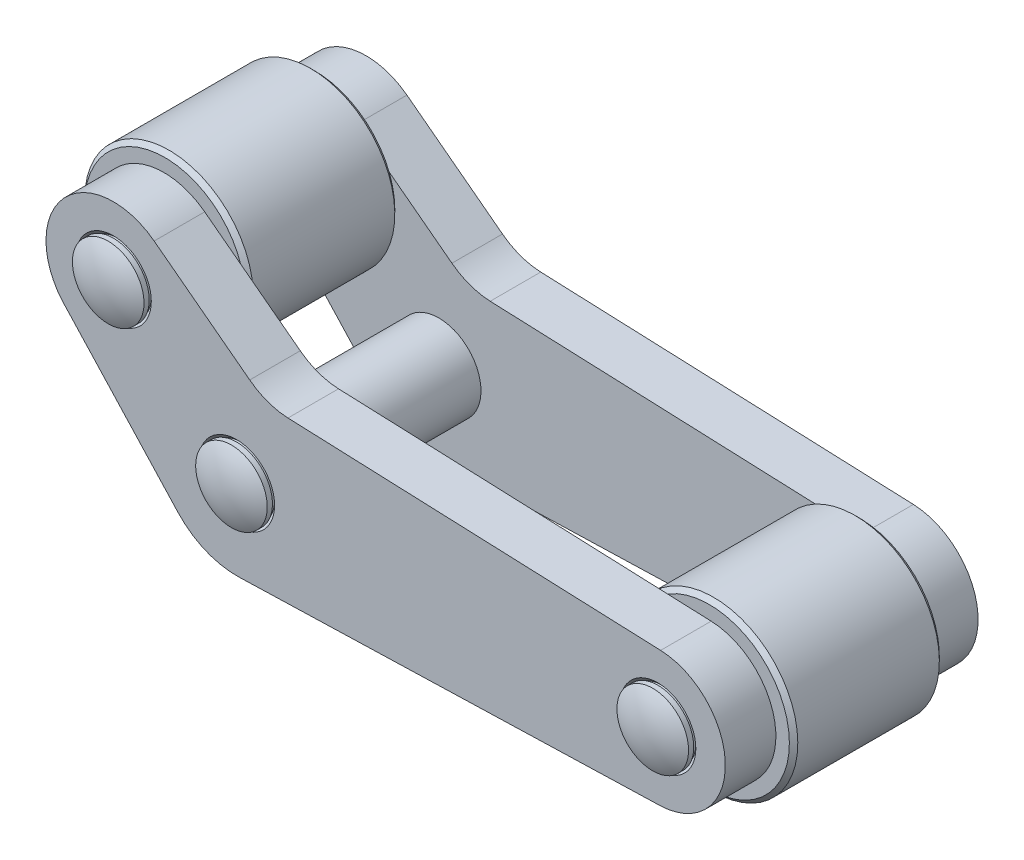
ISO-10303-21;
HEADER;
FILE_DESCRIPTION(('STEP AP214'),'2;1');
FILE_NAME('part.step','',(''),(''),'','','');
FILE_SCHEMA(('AUTOMOTIVE_DESIGN { 1 0 10303 214 1 1 1 1 }'));
ENDSEC;
DATA;
#1=APPLICATION_CONTEXT('core data for automotive mechanical design processes');
#2=APPLICATION_PROTOCOL_DEFINITION('international standard','automotive_design',2000,#1);
#3=PRODUCT_CONTEXT('',#1,'mechanical');
#4=PRODUCT('Part','Part','',(#3));
#5=PRODUCT_RELATED_PRODUCT_CATEGORY('part','',(#4));
#6=PRODUCT_DEFINITION_FORMATION('','',#4);
#7=PRODUCT_DEFINITION_CONTEXT('part definition',#1,'design');
#8=PRODUCT_DEFINITION('design','',#6,#7);
#9=PRODUCT_DEFINITION_SHAPE('','',#8);
#10=(LENGTH_UNIT() NAMED_UNIT(*) SI_UNIT(.MILLI.,.METRE.));
#11=(NAMED_UNIT(*) PLANE_ANGLE_UNIT() SI_UNIT($,.RADIAN.));
#12=(NAMED_UNIT(*) SI_UNIT($,.STERADIAN.) SOLID_ANGLE_UNIT());
#13=UNCERTAINTY_MEASURE_WITH_UNIT(LENGTH_MEASURE(1.E-05),#10,'distance_accuracy_value','');
#14=(GEOMETRIC_REPRESENTATION_CONTEXT(3) GLOBAL_UNCERTAINTY_ASSIGNED_CONTEXT((#13)) GLOBAL_UNIT_ASSIGNED_CONTEXT((#10,
#11,#12)) REPRESENTATION_CONTEXT('',''));
#15=CARTESIAN_POINT('',(0.,0.,0.));
#16=DIRECTION('',(0.,0.,1.));
#17=DIRECTION('',(1.,0.,0.));
#18=AXIS2_PLACEMENT_3D('',#15,#16,#17);
#19=CARTESIAN_POINT('',(22.0000000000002,10.,8.22432388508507));
#20=DIRECTION('',(-0.274038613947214,0.96171868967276,0.));
#21=DIRECTION('',(0.,0.,1.));
#22=AXIS2_PLACEMENT_3D('',#19,#20,#21);
#23=SPHERICAL_SURFACE('',#22,8.52567611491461);
#24=CARTESIAN_POINT('',(22.0000000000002,10.,8.22432388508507));
#25=DIRECTION('',(0.,0.,-1.));
#26=DIRECTION('',(0.961718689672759,0.274038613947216,0.));
#27=AXIS2_PLACEMENT_3D('',#24,#25,#26);
#28=SPHERICAL_SURFACE('',#27,8.52567611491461);
#29=CARTESIAN_POINT('',(22.0000000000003,10.,15.6151731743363));
#30=DIRECTION('',(0.,0.,-1.));
#31=DIRECTION('',(0.961718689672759,0.274038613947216,0.));
#32=AXIS2_PLACEMENT_3D('',#29,#30,#31);
#33=CIRCLE('',#32,4.25);
#34=CARTESIAN_POINT('',(26.0873044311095,11.1646641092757,15.6151731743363));
#35=VERTEX_POINT('',#34);
#36=EDGE_CURVE('P0_E18',#35,#35,#33,.T.);
#37=ORIENTED_EDGE('',*,*,#36,.F.);
#38=EDGE_LOOP('',(#37));
#39=FACE_BOUND('',#38,.T.);
#40=ADVANCED_FACE('P0_F14',(#39),#28,.T.);
#41=CARTESIAN_POINT('',(22.,10.,-8.22432388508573));
#42=DIRECTION('',(-0.274038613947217,0.961718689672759,0.));
#43=DIRECTION('',(0.,0.,-1.));
#44=AXIS2_PLACEMENT_3D('',#41,#42,#43);
#45=SPHERICAL_SURFACE('',#44,8.5256761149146);
#46=CARTESIAN_POINT('',(22.,10.,-8.22432388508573));
#47=DIRECTION('',(0.,0.,1.));
#48=DIRECTION('',(-0.961718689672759,-0.274038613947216,0.));
#49=AXIS2_PLACEMENT_3D('',#46,#47,#48);
#50=SPHERICAL_SURFACE('',#49,8.5256761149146);
#51=CARTESIAN_POINT('',(22.,10.,-15.6151731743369));
#52=DIRECTION('',(0.,0.,1.));
#53=DIRECTION('',(-0.961718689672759,-0.274038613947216,0.));
#54=AXIS2_PLACEMENT_3D('',#51,#52,#53);
#55=CIRCLE('',#54,4.25);
#56=CARTESIAN_POINT('',(17.9126955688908,8.83533589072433,-15.6151731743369));
#57=VERTEX_POINT('',#56);
#58=EDGE_CURVE('P0_E44',#57,#57,#55,.T.);
#59=ORIENTED_EDGE('',*,*,#58,.F.);
#60=EDGE_LOOP('',(#59));
#61=FACE_BOUND('',#60,.T.);
#62=ADVANCED_FACE('P0_F55',(#61),#50,.T.);
#63=CARTESIAN_POINT('',(22.0000000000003,10.,14.9999999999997));
#64=DIRECTION('',(0.,0.,-1.));
#65=DIRECTION('',(0.961718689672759,0.274038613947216,0.));
#66=AXIS2_PLACEMENT_3D('',#63,#64,#65);
#67=CYLINDRICAL_SURFACE('',#66,4.25);
#68=ORIENTED_EDGE('',*,*,#36,.T.);
#69=EDGE_LOOP('',(#68));
#70=FACE_BOUND('',#69,.T.);
#71=CARTESIAN_POINT('',(22.0000000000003,10.,14.9999999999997));
#72=DIRECTION('',(0.,0.,-1.));
#73=DIRECTION('',(0.961718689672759,0.274038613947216,0.));
#74=AXIS2_PLACEMENT_3D('',#71,#72,#73);
#75=CIRCLE('',#74,4.25);
#76=CARTESIAN_POINT('',(26.0873044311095,11.1646641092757,14.9999999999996));
#77=VERTEX_POINT('',#76);
#78=EDGE_CURVE('P0_E42',#77,#77,#75,.F.);
#79=ORIENTED_EDGE('',*,*,#78,.T.);
#80=EDGE_LOOP('',(#79));
#81=FACE_BOUND('',#80,.T.);
#82=ADVANCED_FACE('P0_F51',(#70,#81),#67,.T.);
#83=CARTESIAN_POINT('',(22.,10.,-15.0000000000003));
#84=DIRECTION('',(0.,0.,1.));
#85=DIRECTION('',(-0.961718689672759,-0.274038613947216,0.));
#86=AXIS2_PLACEMENT_3D('',#83,#84,#85);
#87=CYLINDRICAL_SURFACE('',#86,4.25);
#88=ORIENTED_EDGE('',*,*,#58,.T.);
#89=EDGE_LOOP('',(#88));
#90=FACE_BOUND('',#89,.T.);
#91=CARTESIAN_POINT('',(22.,10.,-15.0000000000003));
#92=DIRECTION('',(0.,0.,1.));
#93=DIRECTION('',(-0.961718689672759,-0.274038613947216,0.));
#94=AXIS2_PLACEMENT_3D('',#91,#92,#93);
#95=CIRCLE('',#94,4.25);
#96=CARTESIAN_POINT('',(17.9126955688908,8.83533589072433,-15.0000000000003));
#97=VERTEX_POINT('',#96);
#98=EDGE_CURVE('P0_E39',#97,#97,#95,.F.);
#99=ORIENTED_EDGE('',*,*,#98,.T.);
#100=EDGE_LOOP('',(#99));
#101=FACE_BOUND('',#100,.T.);
#102=ADVANCED_FACE('P0_F95',(#90,#101),#87,.T.);
#103=CARTESIAN_POINT('',(20.8353358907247,14.0873044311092,14.9999999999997));
#104=DIRECTION('',(0.,0.,1.));
#105=DIRECTION('',(-0.961718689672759,-0.274038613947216,0.));
#106=AXIS2_PLACEMENT_3D('',#103,#104,#105);
#107=PLANE('',#106);
#108=ORIENTED_EDGE('',*,*,#78,.F.);
#109=EDGE_LOOP('',(#108));
#110=FACE_BOUND('',#109,.T.);
#111=CARTESIAN_POINT('',(22.0000000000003,10.,14.9999999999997));
#112=DIRECTION('',(0.,0.,-1.));
#113=DIRECTION('',(0.961718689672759,0.274038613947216,0.));
#114=AXIS2_PLACEMENT_3D('',#111,#112,#113);
#115=CIRCLE('',#114,4.);
#116=CARTESIAN_POINT('',(25.8468747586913,11.0961544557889,14.9999999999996));
#117=VERTEX_POINT('',#116);
#118=EDGE_CURVE('P0_E36',#117,#117,#115,.T.);
#119=ORIENTED_EDGE('',*,*,#118,.F.);
#120=EDGE_LOOP('',(#119));
#121=FACE_BOUND('',#120,.T.);
#122=ADVANCED_FACE('P0_F91',(#110,#121),#107,.F.);
#123=CARTESIAN_POINT('',(20.8353358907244,14.0873044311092,-15.0000000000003));
#124=DIRECTION('',(0.,0.,-1.));
#125=DIRECTION('',(0.961718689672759,0.274038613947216,0.));
#126=AXIS2_PLACEMENT_3D('',#123,#124,#125);
#127=PLANE('',#126);
#128=ORIENTED_EDGE('',*,*,#98,.F.);
#129=EDGE_LOOP('',(#128));
#130=FACE_BOUND('',#129,.T.);
#131=CARTESIAN_POINT('',(22.,10.,-15.0000000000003));
#132=DIRECTION('',(0.,0.,-1.));
#133=DIRECTION('',(0.961718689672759,0.274038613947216,0.));
#134=AXIS2_PLACEMENT_3D('',#131,#132,#133);
#135=CIRCLE('',#134,4.);
#136=CARTESIAN_POINT('',(25.846874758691,11.0961544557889,-15.0000000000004));
#137=VERTEX_POINT('',#136);
#138=EDGE_CURVE('P0_E32',#137,#137,#135,.F.);
#139=ORIENTED_EDGE('',*,*,#138,.F.);
#140=EDGE_LOOP('',(#139));
#141=FACE_BOUND('',#140,.T.);
#142=ADVANCED_FACE('P0_F87',(#130,#141),#127,.F.);
#143=CARTESIAN_POINT('',(22.,10.,-16.7500000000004));
#144=DIRECTION('',(0.,0.,-1.));
#145=DIRECTION('',(0.961718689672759,0.274038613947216,0.));
#146=AXIS2_PLACEMENT_3D('',#143,#144,#145);
#147=CYLINDRICAL_SURFACE('',#146,4.);
#148=ORIENTED_EDGE('',*,*,#118,.T.);
#149=EDGE_LOOP('',(#148));
#150=FACE_BOUND('',#149,.T.);
#151=CARTESIAN_POINT('',(22.0000000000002,10.,9.49999999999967));
#152=DIRECTION('',(0.,0.,1.));
#153=DIRECTION('',(-0.961718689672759,-0.274038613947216,0.));
#154=AXIS2_PLACEMENT_3D('',#151,#152,#153);
#155=CIRCLE('',#154,4.);
#156=CARTESIAN_POINT('',(18.1531252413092,8.90384554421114,9.4999999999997));
#157=VERTEX_POINT('',#156);
#158=EDGE_CURVE('P0_E35',#157,#157,#155,.T.);
#159=ORIENTED_EDGE('',*,*,#158,.T.);
#160=EDGE_LOOP('',(#159));
#161=FACE_BOUND('',#160,.T.);
#162=ADVANCED_FACE('P0_F83',(#150,#161),#147,.T.);
#163=CARTESIAN_POINT('',(22.,10.,-16.7500000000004));
#164=DIRECTION('',(0.,0.,-1.));
#165=DIRECTION('',(0.961718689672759,0.274038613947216,0.));
#166=AXIS2_PLACEMENT_3D('',#163,#164,#165);
#167=CYLINDRICAL_SURFACE('',#166,4.);
#168=CARTESIAN_POINT('',(22.,10.,-9.50000000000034));
#169=DIRECTION('',(0.,0.,-1.));
#170=DIRECTION('',(-0.961718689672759,-0.274038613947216,0.));
#171=AXIS2_PLACEMENT_3D('',#168,#169,#170);
#172=CIRCLE('',#171,4.);
#173=CARTESIAN_POINT('',(18.153125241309,8.90384554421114,-9.50000000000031));
#174=VERTEX_POINT('',#173);
#175=EDGE_CURVE('P0_E196',#174,#174,#172,.T.);
#176=ORIENTED_EDGE('',*,*,#175,.T.);
#177=EDGE_LOOP('',(#176));
#178=FACE_BOUND('',#177,.T.);
#179=ORIENTED_EDGE('',*,*,#138,.T.);
#180=EDGE_LOOP('',(#179));
#181=FACE_BOUND('',#180,.T.);
#182=ADVANCED_FACE('P0_F79',(#178,#181),#167,.T.);
#183=CARTESIAN_POINT('',(22.0000000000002,10.,9.49999999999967));
#184=DIRECTION('',(0.,0.,-1.));
#185=DIRECTION('',(0.274038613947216,-0.961718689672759,0.));
#186=AXIS2_PLACEMENT_3D('',#183,#184,#185);
#187=TOROIDAL_SURFACE('',#186,4.5,0.5);
#188=ORIENTED_EDGE('',*,*,#158,.F.);
#189=EDGE_LOOP('',(#188));
#190=FACE_BOUND('',#189,.T.);
#191=CARTESIAN_POINT('',(22.0000000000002,10.,8.99999999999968));
#192=DIRECTION('',(0.,0.,-1.));
#193=DIRECTION('',(0.274038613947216,-0.961718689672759,0.));
#194=AXIS2_PLACEMENT_3D('',#191,#192,#193);
#195=CIRCLE('',#194,4.5);
#196=CARTESIAN_POINT('',(23.2331737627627,5.67226589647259,8.99999999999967));
#197=VERTEX_POINT('',#196);
#198=EDGE_CURVE('P0_E197',#197,#197,#195,.F.);
#199=ORIENTED_EDGE('',*,*,#198,.T.);
#200=EDGE_LOOP('',(#199));
#201=FACE_BOUND('',#200,.T.);
#202=ADVANCED_FACE('P0_F82',(#190,#201),#187,.F.);
#203=CARTESIAN_POINT('',(22.,10.,-9.50000000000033));
#204=DIRECTION('',(0.,0.,-1.));
#205=DIRECTION('',(0.274038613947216,-0.961718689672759,0.));
#206=AXIS2_PLACEMENT_3D('',#203,#204,#205);
#207=TOROIDAL_SURFACE('',#206,4.5,0.5);
#208=CARTESIAN_POINT('',(22.,10.,-9.00000000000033));
#209=DIRECTION('',(0.,0.,-1.));
#210=DIRECTION('',(0.274038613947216,-0.961718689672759,0.));
#211=AXIS2_PLACEMENT_3D('',#208,#209,#210);
#212=CIRCLE('',#211,4.5);
#213=CARTESIAN_POINT('',(23.2331737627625,5.67226589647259,-9.00000000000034));
#214=VERTEX_POINT('',#213);
#215=EDGE_CURVE('P0_E27',#214,#214,#212,.T.);
#216=ORIENTED_EDGE('',*,*,#215,.T.);
#217=EDGE_LOOP('',(#216));
#218=FACE_BOUND('',#217,.T.);
#219=ORIENTED_EDGE('',*,*,#175,.F.);
#220=EDGE_LOOP('',(#219));
#221=FACE_BOUND('',#220,.T.);
#222=ADVANCED_FACE('P0_F16',(#218,#221),#207,.F.);
#223=CARTESIAN_POINT('',(20.7668262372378,14.3277341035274,8.99999999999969));
#224=DIRECTION('',(0.,0.,-1.));
#225=DIRECTION('',(0.961718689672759,0.274038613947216,0.));
#226=AXIS2_PLACEMENT_3D('',#223,#224,#225);
#227=PLANE('',#226);
#228=CARTESIAN_POINT('',(22.0000000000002,10.,8.99999999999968));
#229=DIRECTION('',(0.,0.,-1.));
#230=DIRECTION('',(0.961718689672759,0.274038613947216,0.));
#231=AXIS2_PLACEMENT_3D('',#228,#229,#230);
#232=CIRCLE('',#231,5.);
#233=CARTESIAN_POINT('',(26.808593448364,11.3701930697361,8.99999999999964));
#234=VERTEX_POINT('',#233);
#235=EDGE_CURVE('P0_E22',#234,#234,#232,.T.);
#236=ORIENTED_EDGE('',*,*,#235,.F.);
#237=EDGE_LOOP('',(#236));
#238=FACE_BOUND('',#237,.T.);
#239=ORIENTED_EDGE('',*,*,#198,.F.);
#240=EDGE_LOOP('',(#239));
#241=FACE_BOUND('',#240,.T.);
#242=ADVANCED_FACE('P0_F71',(#238,#241),#227,.F.);
#243=CARTESIAN_POINT('',(20.629806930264,14.8085934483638,-9.00000000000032));
#244=DIRECTION('',(0.,0.,1.));
#245=DIRECTION('',(-0.961718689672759,-0.274038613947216,0.));
#246=AXIS2_PLACEMENT_3D('',#243,#244,#245);
#247=PLANE('',#246);
#248=ORIENTED_EDGE('',*,*,#215,.F.);
#249=EDGE_LOOP('',(#248));
#250=FACE_BOUND('',#249,.T.);
#251=CARTESIAN_POINT('',(22.,10.,-9.00000000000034));
#252=DIRECTION('',(0.,0.,-1.));
#253=DIRECTION('',(0.961718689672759,0.274038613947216,0.));
#254=AXIS2_PLACEMENT_3D('',#251,#252,#253);
#255=CIRCLE('',#254,5.);
#256=CARTESIAN_POINT('',(26.8085934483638,11.3701930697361,-9.00000000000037));
#257=VERTEX_POINT('',#256);
#258=EDGE_CURVE('P0_E10',#257,#257,#255,.F.);
#259=ORIENTED_EDGE('',*,*,#258,.F.);
#260=EDGE_LOOP('',(#259));
#261=FACE_BOUND('',#260,.T.);
#262=ADVANCED_FACE('P0_F66',(#250,#261),#247,.F.);
#263=CARTESIAN_POINT('',(22.,10.,-16.7500000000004));
#264=DIRECTION('',(0.,0.,-1.));
#265=DIRECTION('',(0.961718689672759,0.274038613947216,0.));
#266=AXIS2_PLACEMENT_3D('',#263,#264,#265);
#267=CYLINDRICAL_SURFACE('',#266,5.);
#268=ORIENTED_EDGE('',*,*,#258,.T.);
#269=EDGE_LOOP('',(#268));
#270=FACE_BOUND('',#269,.T.);
#271=ORIENTED_EDGE('',*,*,#235,.T.);
#272=EDGE_LOOP('',(#271));
#273=FACE_BOUND('',#272,.T.);
#274=ADVANCED_FACE('P0_F64',(#270,#273),#267,.T.);
#275=CLOSED_SHELL('',(#40,#62,#82,#102,#122,#142,#162,#182,#202,#222,#242,#262,#274));
#276=MANIFOLD_SOLID_BREP('P0_B1',#275);
#277=CARTESIAN_POINT('',(-42.6270740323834,23.6399672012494,-8.89999999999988));
#278=DIRECTION('',(0.,0.,-1.));
#279=DIRECTION('',(-0.0908375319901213,-0.99586572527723,0.));
#280=AXIS2_PLACEMENT_3D('',#277,#278,#279);
#281=CYLINDRICAL_SURFACE('',#280,5.);
#282=CARTESIAN_POINT('',(-42.6270740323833,23.6399672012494,8.70000000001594));
#283=DIRECTION('',(0.,0.,1.));
#284=DIRECTION('',(0.0908375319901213,0.99586572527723,0.));
#285=AXIS2_PLACEMENT_3D('',#282,#283,#284);
#286=CIRCLE('',#285,4.99999999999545);
#287=CARTESIAN_POINT('',(-42.1728863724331,28.619295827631,8.70000000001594));
#288=VERTEX_POINT('',#287);
#289=EDGE_CURVE('P1_E32',#288,#288,#286,.T.);
#290=ORIENTED_EDGE('',*,*,#289,.T.);
#291=EDGE_LOOP('',(#290));
#292=FACE_BOUND('',#291,.T.);
#293=CARTESIAN_POINT('',(-42.6270740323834,23.6399672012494,-8.69999999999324));
#294=DIRECTION('',(0.,0.,-1.));
#295=DIRECTION('',(-0.0908375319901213,-0.99586572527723,0.));
#296=AXIS2_PLACEMENT_3D('',#293,#294,#295);
#297=CIRCLE('',#296,4.99999999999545);
#298=CARTESIAN_POINT('',(-43.0812616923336,18.6606385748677,-8.69999999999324));
#299=VERTEX_POINT('',#298);
#300=EDGE_CURVE('P1_E29',#299,#299,#297,.T.);
#301=ORIENTED_EDGE('',*,*,#300,.T.);
#302=EDGE_LOOP('',(#301));
#303=FACE_BOUND('',#302,.T.);
#304=ADVANCED_FACE('P1_F14',(#292,#303),#281,.F.);
#305=CARTESIAN_POINT('',(-42.6270740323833,23.6399672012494,8.89999999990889));
#306=DIRECTION('',(0.,0.,1.));
#307=DIRECTION('',(0.0908375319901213,0.99586572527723,0.));
#308=AXIS2_PLACEMENT_3D('',#305,#306,#307);
#309=CONICAL_SURFACE('',#308,5.19999999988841,0.785398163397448);
#310=ORIENTED_EDGE('',*,*,#289,.F.);
#311=EDGE_LOOP('',(#310));
#312=FACE_BOUND('',#311,.T.);
#313=CARTESIAN_POINT('',(-42.6270740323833,23.6399672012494,8.89999999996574));
#314=DIRECTION('',(0.,0.,1.));
#315=DIRECTION('',(0.0908375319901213,0.99586572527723,0.));
#316=AXIS2_PLACEMENT_3D('',#313,#314,#315);
#317=CIRCLE('',#316,5.19999999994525);
#318=CARTESIAN_POINT('',(-42.1547188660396,28.8184689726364,8.89999999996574));
#319=VERTEX_POINT('',#318);
#320=EDGE_CURVE('P1_E17',#319,#319,#317,.T.);
#321=ORIENTED_EDGE('',*,*,#320,.T.);
#322=EDGE_LOOP('',(#321));
#323=FACE_BOUND('',#322,.T.);
#324=ADVANCED_FACE('P1_F46',(#312,#323),#309,.F.);
#325=CARTESIAN_POINT('',(-42.6270740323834,23.6399672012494,-8.8999999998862));
#326=DIRECTION('',(0.,0.,-1.));
#327=DIRECTION('',(-0.0908375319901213,-0.99586572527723,0.));
#328=AXIS2_PLACEMENT_3D('',#325,#326,#327);
#329=CONICAL_SURFACE('',#328,5.19999999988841,0.785398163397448);
#330=ORIENTED_EDGE('',*,*,#300,.F.);
#331=EDGE_LOOP('',(#330));
#332=FACE_BOUND('',#331,.T.);
#333=CARTESIAN_POINT('',(-42.6270740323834,23.6399672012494,-8.89999999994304));
#334=DIRECTION('',(0.,0.,-1.));
#335=DIRECTION('',(-0.0908375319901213,-0.99586572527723,0.));
#336=AXIS2_PLACEMENT_3D('',#333,#334,#335);
#337=CIRCLE('',#336,5.19999999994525);
#338=CARTESIAN_POINT('',(-43.0994291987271,18.4614654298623,-8.89999999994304));
#339=VERTEX_POINT('',#338);
#340=EDGE_CURVE('P1_E39',#339,#339,#337,.T.);
#341=ORIENTED_EDGE('',*,*,#340,.T.);
#342=EDGE_LOOP('',(#341));
#343=FACE_BOUND('',#342,.T.);
#344=ADVANCED_FACE('P1_F52',(#332,#343),#329,.F.);
#345=CARTESIAN_POINT('',(-37.6477454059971,23.1857795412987,8.9));
#346=DIRECTION('',(0.,0.,-1.));
#347=DIRECTION('',(-0.0908375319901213,-0.99586572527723,0.));
#348=AXIS2_PLACEMENT_3D('',#345,#346,#347);
#349=PLANE('',#348);
#350=ORIENTED_EDGE('',*,*,#320,.F.);
#351=EDGE_LOOP('',(#350));
#352=FACE_BOUND('',#351,.T.);
#353=CARTESIAN_POINT('',(-42.6270740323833,23.6399672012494,8.90000000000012));
#354=DIRECTION('',(0.,0.,-1.));
#355=DIRECTION('',(-0.0908375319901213,-0.99586572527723,0.));
#356=AXIS2_PLACEMENT_3D('',#353,#354,#355);
#357=CIRCLE('',#356,9.5);
#358=CARTESIAN_POINT('',(-43.4900305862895,14.1792428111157,8.90000000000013));
#359=VERTEX_POINT('',#358);
#360=EDGE_CURVE('P1_E37',#359,#359,#357,.T.);
#361=ORIENTED_EDGE('',*,*,#360,.F.);
#362=EDGE_LOOP('',(#361));
#363=FACE_BOUND('',#362,.T.);
#364=ADVANCED_FACE('P1_F48',(#352,#363),#349,.F.);
#365=CARTESIAN_POINT('',(-33.1663496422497,22.7770106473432,-8.9));
#366=DIRECTION('',(0.,0.,1.));
#367=DIRECTION('',(0.0908375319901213,0.99586572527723,0.));
#368=AXIS2_PLACEMENT_3D('',#365,#366,#367);
#369=PLANE('',#368);
#370=ORIENTED_EDGE('',*,*,#340,.F.);
#371=EDGE_LOOP('',(#370));
#372=FACE_BOUND('',#371,.T.);
#373=CARTESIAN_POINT('',(-42.6270740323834,23.6399672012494,-8.89999999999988));
#374=DIRECTION('',(0.,0.,1.));
#375=DIRECTION('',(0.0908375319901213,0.99586572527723,0.));
#376=AXIS2_PLACEMENT_3D('',#373,#374,#375);
#377=CIRCLE('',#376,9.5);
#378=CARTESIAN_POINT('',(-41.7641174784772,33.100691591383,-8.89999999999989));
#379=VERTEX_POINT('',#378);
#380=EDGE_CURVE('P1_E26',#379,#379,#377,.T.);
#381=ORIENTED_EDGE('',*,*,#380,.F.);
#382=EDGE_LOOP('',(#381));
#383=FACE_BOUND('',#382,.T.);
#384=ADVANCED_FACE('P1_F51',(#372,#383),#369,.F.);
#385=CARTESIAN_POINT('',(-42.6270740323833,23.6399672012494,8.40000000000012));
#386=DIRECTION('',(0.,0.,-1.));
#387=DIRECTION('',(-0.0908375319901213,-0.99586572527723,0.));
#388=AXIS2_PLACEMENT_3D('',#385,#386,#387);
#389=CONICAL_SURFACE('',#388,10.,0.785398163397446);
#390=CARTESIAN_POINT('',(-42.6270740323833,23.6399672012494,8.40000000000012));
#391=DIRECTION('',(0.,0.,-1.));
#392=DIRECTION('',(-0.0908375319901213,-0.99586572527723,0.));
#393=AXIS2_PLACEMENT_3D('',#390,#391,#392);
#394=CIRCLE('',#393,10.);
#395=CARTESIAN_POINT('',(-43.5354493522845,13.6813099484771,8.40000000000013));
#396=VERTEX_POINT('',#395);
#397=EDGE_CURVE('P1_E21',#396,#396,#394,.T.);
#398=ORIENTED_EDGE('',*,*,#397,.F.);
#399=EDGE_LOOP('',(#398));
#400=FACE_BOUND('',#399,.T.);
#401=ORIENTED_EDGE('',*,*,#360,.T.);
#402=EDGE_LOOP('',(#401));
#403=FACE_BOUND('',#402,.T.);
#404=ADVANCED_FACE('P1_F56',(#400,#403),#389,.T.);
#405=CARTESIAN_POINT('',(-42.6270740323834,23.6399672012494,-8.39999999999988));
#406=DIRECTION('',(0.,0.,1.));
#407=DIRECTION('',(0.0908375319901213,0.99586572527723,0.));
#408=AXIS2_PLACEMENT_3D('',#405,#406,#407);
#409=CONICAL_SURFACE('',#408,10.,0.785398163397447);
#410=CARTESIAN_POINT('',(-42.6270740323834,23.6399672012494,-8.39999999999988));
#411=DIRECTION('',(0.,0.,-1.));
#412=DIRECTION('',(-0.0908375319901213,-0.99586572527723,0.));
#413=AXIS2_PLACEMENT_3D('',#410,#411,#412);
#414=CIRCLE('',#413,10.);
#415=CARTESIAN_POINT('',(-43.5354493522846,13.6813099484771,-8.39999999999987));
#416=VERTEX_POINT('',#415);
#417=EDGE_CURVE('P1_E10',#416,#416,#414,.F.);
#418=ORIENTED_EDGE('',*,*,#417,.F.);
#419=EDGE_LOOP('',(#418));
#420=FACE_BOUND('',#419,.T.);
#421=ORIENTED_EDGE('',*,*,#380,.T.);
#422=EDGE_LOOP('',(#421));
#423=FACE_BOUND('',#422,.T.);
#424=ADVANCED_FACE('P1_F58',(#420,#423),#409,.T.);
#425=CARTESIAN_POINT('',(-42.6270740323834,23.6399672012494,-8.89999999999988));
#426=DIRECTION('',(0.,0.,-1.));
#427=DIRECTION('',(-0.0908375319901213,-0.99586572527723,0.));
#428=AXIS2_PLACEMENT_3D('',#425,#426,#427);
#429=CYLINDRICAL_SURFACE('',#428,10.);
#430=ORIENTED_EDGE('',*,*,#417,.T.);
#431=EDGE_LOOP('',(#430));
#432=FACE_BOUND('',#431,.T.);
#433=ORIENTED_EDGE('',*,*,#397,.T.);
#434=EDGE_LOOP('',(#433));
#435=FACE_BOUND('',#434,.T.);
#436=ADVANCED_FACE('P1_F66',(#432,#435),#429,.T.);
#437=CLOSED_SHELL('',(#304,#324,#344,#364,#384,#404,#424,#436));
#438=MANIFOLD_SOLID_BREP('P1_B1',#437);
#439=CARTESIAN_POINT('',(22.,9.99999999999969,-9.00000000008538));
#440=DIRECTION('',(0.,0.,1.));
#441=DIRECTION('',(0.,1.,0.));
#442=AXIS2_PLACEMENT_3D('',#439,#440,#441);
#443=CONICAL_SURFACE('',#442,4.49999999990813,0.785398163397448);
#444=CARTESIAN_POINT('',(22.,9.99999999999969,-9.50000000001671));
#445=DIRECTION('',(0.,0.,-1.));
#446=DIRECTION('',(-1.,0.,0.));
#447=AXIS2_PLACEMENT_3D('',#444,#445,#446);
#448=CIRCLE('',#447,4.);
#449=CARTESIAN_POINT('',(18.,9.99999999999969,-9.50000000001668));
#450=VERTEX_POINT('',#449);
#451=EDGE_CURVE('P2_E125',#450,#450,#448,.T.);
#452=ORIENTED_EDGE('',*,*,#451,.T.);
#453=EDGE_LOOP('',(#452));
#454=FACE_BOUND('',#453,.T.);
#455=CARTESIAN_POINT('',(22.,9.99999999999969,-8.99999999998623));
#456=DIRECTION('',(0.,0.,1.));
#457=DIRECTION('',(0.,1.,0.));
#458=AXIS2_PLACEMENT_3D('',#455,#456,#457);
#459=CIRCLE('',#458,4.50000000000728);
#460=CARTESIAN_POINT('',(22.,14.500000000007,-8.99999999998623));
#461=VERTEX_POINT('',#460);
#462=EDGE_CURVE('P2_E19',#461,#461,#459,.T.);
#463=ORIENTED_EDGE('',*,*,#462,.T.);
#464=EDGE_LOOP('',(#463));
#465=FACE_BOUND('',#464,.T.);
#466=ADVANCED_FACE('P2_F16',(#454,#465),#443,.F.);
#467=CARTESIAN_POINT('',(-28.,9.99999999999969,-9.00000000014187));
#468=DIRECTION('',(0.,0.,1.));
#469=DIRECTION('',(1.,0.,0.));
#470=AXIS2_PLACEMENT_3D('',#467,#468,#469);
#471=CONICAL_SURFACE('',#470,4.49999999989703,0.785398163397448);
#472=CARTESIAN_POINT('',(-28.,9.99999999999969,-9.50000000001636));
#473=DIRECTION('',(0.,0.,-1.));
#474=DIRECTION('',(-1.,0.,0.));
#475=AXIS2_PLACEMENT_3D('',#472,#473,#474);
#476=CIRCLE('',#475,3.99999999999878);
#477=CARTESIAN_POINT('',(-31.9999999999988,9.99999999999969,-9.50000000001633));
#478=VERTEX_POINT('',#477);
#479=EDGE_CURVE('P2_E122',#478,#478,#476,.T.);
#480=ORIENTED_EDGE('',*,*,#479,.T.);
#481=EDGE_LOOP('',(#480));
#482=FACE_BOUND('',#481,.T.);
#483=CARTESIAN_POINT('',(-28.,9.99999999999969,-9.00000000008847));
#484=DIRECTION('',(0.,0.,1.));
#485=DIRECTION('',(1.,0.,0.));
#486=AXIS2_PLACEMENT_3D('',#483,#484,#485);
#487=CIRCLE('',#486,4.49999999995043);
#488=CARTESIAN_POINT('',(-23.5000000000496,9.99999999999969,-9.0000000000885));
#489=VERTEX_POINT('',#488);
#490=EDGE_CURVE('P2_E155',#489,#489,#487,.T.);
#491=ORIENTED_EDGE('',*,*,#490,.T.);
#492=EDGE_LOOP('',(#491));
#493=FACE_BOUND('',#492,.T.);
#494=ADVANCED_FACE('P2_F176',(#482,#493),#471,.F.);
#495=CARTESIAN_POINT('',(-42.6270740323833,23.6399672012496,-9.00000000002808));
#496=DIRECTION('',(0.,0.,1.));
#497=DIRECTION('',(1.,0.,0.));
#498=AXIS2_PLACEMENT_3D('',#495,#496,#497);
#499=CONICAL_SURFACE('',#498,4.49999999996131,0.785398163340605);
#500=CARTESIAN_POINT('',(-42.6270740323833,23.6399672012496,-9.5000000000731));
#501=DIRECTION('',(0.,0.,-1.));
#502=DIRECTION('',(-1.,0.,0.));
#503=AXIS2_PLACEMENT_3D('',#500,#501,#502);
#504=CIRCLE('',#503,4.);
#505=CARTESIAN_POINT('',(-46.6270740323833,23.6399672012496,-9.50000000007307));
#506=VERTEX_POINT('',#505);
#507=EDGE_CURVE('P2_E88',#506,#506,#504,.T.);
#508=ORIENTED_EDGE('',*,*,#507,.T.);
#509=EDGE_LOOP('',(#508));
#510=FACE_BOUND('',#509,.T.);
#511=CARTESIAN_POINT('',(-42.6270740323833,23.6399672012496,-8.99999999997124));
#512=DIRECTION('',(0.,0.,1.));
#513=DIRECTION('',(1.,0.,0.));
#514=AXIS2_PLACEMENT_3D('',#511,#512,#513);
#515=CIRCLE('',#514,4.50000000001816);
#516=CARTESIAN_POINT('',(-38.1270740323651,23.6399672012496,-8.99999999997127));
#517=VERTEX_POINT('',#516);
#518=EDGE_CURVE('P2_E127',#517,#517,#515,.T.);
#519=ORIENTED_EDGE('',*,*,#518,.T.);
#520=EDGE_LOOP('',(#519));
#521=FACE_BOUND('',#520,.T.);
#522=ADVANCED_FACE('P2_F165',(#510,#521),#499,.F.);
#523=CARTESIAN_POINT('',(-42.6270740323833,23.6399672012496,-8.99999999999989));
#524=DIRECTION('',(0.,0.,-1.));
#525=DIRECTION('',(-1.,0.,0.));
#526=AXIS2_PLACEMENT_3D('',#523,#524,#525);
#527=PLANE('',#526);
#528=ORIENTED_EDGE('',*,*,#518,.F.);
#529=EDGE_LOOP('',(#528));
#530=FACE_BOUND('',#529,.T.);
#531=ORIENTED_EDGE('',*,*,#490,.F.);
#532=EDGE_LOOP('',(#531));
#533=FACE_BOUND('',#532,.T.);
#534=ORIENTED_EDGE('',*,*,#462,.F.);
#535=EDGE_LOOP('',(#534));
#536=FACE_BOUND('',#535,.T.);
#537=CARTESIAN_POINT('',(-28.,9.99999999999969,-9.));
#538=DIRECTION('',(0.,0.,-1.));
#539=DIRECTION('',(-1.,0.,0.));
#540=AXIS2_PLACEMENT_3D('',#537,#538,#539);
#541=CIRCLE('',#540,9.5);
#542=CARTESIAN_POINT('',(-27.715,0.50427596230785,-9.));
#543=VERTEX_POINT('',#542);
#544=CARTESIAN_POINT('',(-34.998887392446,3.57617129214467,-9.));
#545=VERTEX_POINT('',#544);
#546=EDGE_CURVE('P2_E79',#543,#545,#541,.T.);
#547=ORIENTED_EDGE('',*,*,#546,.F.);
#548=DIRECTION('',(-0.999549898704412,-0.0299999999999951,0.));
#549=VECTOR('',#548,1.);
#550=CARTESIAN_POINT('',(-27.715,0.504275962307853,-9.));
#551=LINE('',#550,#549);
#552=CARTESIAN_POINT('',(22.24,2.00360081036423,-9.00000000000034));
#553=VERTEX_POINT('',#552);
#554=EDGE_CURVE('P2_E83',#553,#543,#551,.T.);
#555=ORIENTED_EDGE('',*,*,#554,.F.);
#556=CARTESIAN_POINT('',(22.,9.99999999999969,-9.00000000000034));
#557=DIRECTION('',(0.,0.,-1.));
#558=DIRECTION('',(-1.,0.,0.));
#559=AXIS2_PLACEMENT_3D('',#556,#557,#558);
#560=CIRCLE('',#559,8.);
#561=CARTESIAN_POINT('',(22.32,17.9935974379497,-9.00000000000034));
#562=VERTEX_POINT('',#561);
#563=EDGE_CURVE('P2_E102',#562,#553,#560,.T.);
#564=ORIENTED_EDGE('',*,*,#563,.F.);
#565=DIRECTION('',(0.999199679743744,-0.0400000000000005,0.));
#566=VECTOR('',#565,1.);
#567=CARTESIAN_POINT('',(22.32,17.9935974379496,-9.00000000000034));
#568=LINE('',#567,#566);
#569=CARTESIAN_POINT('',(-21.9083912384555,19.7641500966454,-9.));
#570=VERTEX_POINT('',#569);
#571=EDGE_CURVE('P2_E108',#570,#562,#568,.T.);
#572=ORIENTED_EDGE('',*,*,#571,.F.);
#573=CARTESIAN_POINT('',(-21.5883912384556,27.7577475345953,-9.));
#574=DIRECTION('',(0.,0.,-1.));
#575=DIRECTION('',(-1.,0.,0.));
#576=AXIS2_PLACEMENT_3D('',#573,#574,#575);
#577=CIRCLE('',#576,8.);
#578=CARTESIAN_POINT('',(-26.4488158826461,21.4035149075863,-9.));
#579=VERTEX_POINT('',#578);
#580=EDGE_CURVE('P2_E149',#570,#579,#577,.T.);
#581=ORIENTED_EDGE('',*,*,#580,.T.);
#582=DIRECTION('',(0.796528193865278,-0.604601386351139,0.));
#583=VECTOR('',#582,1.);
#584=CARTESIAN_POINT('',(-37.7902383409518,30.0121740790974,-9.));
#585=LINE('',#584,#583);
#586=CARTESIAN_POINT('',(-37.7902383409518,30.0121740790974,-9.));
#587=VERTEX_POINT('',#586);
#588=EDGE_CURVE('P2_E113',#587,#579,#585,.T.);
#589=ORIENTED_EDGE('',*,*,#588,.F.);
#590=CARTESIAN_POINT('',(-42.6270740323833,23.6399672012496,-8.99999999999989));
#591=DIRECTION('',(0.,0.,-1.));
#592=DIRECTION('',(-1.,0.,0.));
#593=AXIS2_PLACEMENT_3D('',#590,#591,#592);
#594=CIRCLE('',#593,7.99999999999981);
#595=CARTESIAN_POINT('',(-48.6463579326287,18.3704111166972,-8.99999999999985));
#596=VERTEX_POINT('',#595);
#597=EDGE_CURVE('P2_E117',#596,#587,#594,.T.);
#598=ORIENTED_EDGE('',*,*,#597,.F.);
#599=DIRECTION('',(-0.678045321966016,0.735020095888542,0.));
#600=VECTOR('',#599,1.);
#601=CARTESIAN_POINT('',(-48.6463579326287,18.3704111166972,-8.99999999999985));
#602=LINE('',#601,#600);
#603=EDGE_CURVE('P2_E85',#545,#596,#602,.T.);
#604=ORIENTED_EDGE('',*,*,#603,.F.);
#605=EDGE_LOOP('',(#547,#555,#564,#572,#581,#589,#598,#604));
#606=FACE_BOUND('',#605,.T.);
#607=ADVANCED_FACE('P2_F81',(#530,#533,#536,#606),#527,.F.);
#608=CARTESIAN_POINT('',(22.,9.99999999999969,-9.00000000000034));
#609=DIRECTION('',(0.,0.,-1.));
#610=DIRECTION('',(-1.,0.,0.));
#611=AXIS2_PLACEMENT_3D('',#608,#609,#610);
#612=CYLINDRICAL_SURFACE('',#611,4.);
#613=ORIENTED_EDGE('',*,*,#451,.F.);
#614=EDGE_LOOP('',(#613));
#615=FACE_BOUND('',#614,.T.);
#616=CARTESIAN_POINT('',(22.,9.99999999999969,-14.5000000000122));
#617=DIRECTION('',(0.,0.,-1.));
#618=DIRECTION('',(-1.,0.,0.));
#619=AXIS2_PLACEMENT_3D('',#616,#617,#618);
#620=CIRCLE('',#619,3.99999999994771);
#621=CARTESIAN_POINT('',(18.0000000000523,9.99999999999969,-14.5000000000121));
#622=VERTEX_POINT('',#621);
#623=EDGE_CURVE('P2_E106',#622,#622,#620,.T.);
#624=ORIENTED_EDGE('',*,*,#623,.T.);
#625=EDGE_LOOP('',(#624));
#626=FACE_BOUND('',#625,.T.);
#627=ADVANCED_FACE('P2_F164',(#615,#626),#612,.F.);
#628=CARTESIAN_POINT('',(-28.,9.99999999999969,-9.));
#629=DIRECTION('',(0.,0.,-1.));
#630=DIRECTION('',(-1.,0.,0.));
#631=AXIS2_PLACEMENT_3D('',#628,#629,#630);
#632=CYLINDRICAL_SURFACE('',#631,3.99999999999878);
#633=ORIENTED_EDGE('',*,*,#479,.F.);
#634=EDGE_LOOP('',(#633));
#635=FACE_BOUND('',#634,.T.);
#636=CARTESIAN_POINT('',(-28.,9.99999999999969,-14.499999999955));
#637=DIRECTION('',(0.,0.,-1.));
#638=DIRECTION('',(-1.,0.,0.));
#639=AXIS2_PLACEMENT_3D('',#636,#637,#638);
#640=CIRCLE('',#639,3.99999999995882);
#641=CARTESIAN_POINT('',(-31.9999999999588,9.99999999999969,-14.4999999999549));
#642=VERTEX_POINT('',#641);
#643=EDGE_CURVE('P2_E240',#642,#642,#640,.T.);
#644=ORIENTED_EDGE('',*,*,#643,.T.);
#645=EDGE_LOOP('',(#644));
#646=FACE_BOUND('',#645,.T.);
#647=ADVANCED_FACE('P2_F173',(#635,#646),#632,.F.);
#648=CARTESIAN_POINT('',(-42.6270740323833,23.6399672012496,-8.99999999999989));
#649=DIRECTION('',(0.,0.,-1.));
#650=DIRECTION('',(-1.,0.,0.));
#651=AXIS2_PLACEMENT_3D('',#648,#649,#650);
#652=CYLINDRICAL_SURFACE('',#651,4.);
#653=ORIENTED_EDGE('',*,*,#507,.F.);
#654=EDGE_LOOP('',(#653));
#655=FACE_BOUND('',#654,.T.);
#656=CARTESIAN_POINT('',(-42.6270740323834,23.6399672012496,-14.4999999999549));
#657=DIRECTION('',(0.,0.,-1.));
#658=DIRECTION('',(-1.,0.,0.));
#659=AXIS2_PLACEMENT_3D('',#656,#657,#658);
#660=CIRCLE('',#659,3.99999999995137);
#661=CARTESIAN_POINT('',(-46.6270740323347,23.6399672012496,-14.4999999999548));
#662=VERTEX_POINT('',#661);
#663=EDGE_CURVE('P2_E147',#662,#662,#660,.T.);
#664=ORIENTED_EDGE('',*,*,#663,.T.);
#665=EDGE_LOOP('',(#664));
#666=FACE_BOUND('',#665,.T.);
#667=ADVANCED_FACE('P2_F228',(#655,#666),#652,.F.);
#668=CARTESIAN_POINT('',(-28.,9.99999999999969,-9.));
#669=DIRECTION('',(0.,0.,-1.));
#670=DIRECTION('',(-1.,0.,0.));
#671=AXIS2_PLACEMENT_3D('',#668,#669,#670);
#672=CYLINDRICAL_SURFACE('',#671,9.5);
#673=CARTESIAN_POINT('',(-28.,9.99999999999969,-15.));
#674=DIRECTION('',(0.,0.,-1.));
#675=DIRECTION('',(-1.,0.,0.));
#676=AXIS2_PLACEMENT_3D('',#673,#674,#675);
#677=CIRCLE('',#676,9.5);
#678=CARTESIAN_POINT('',(-27.715,0.504275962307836,-15.));
#679=VERTEX_POINT('',#678);
#680=CARTESIAN_POINT('',(-34.9988873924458,3.57617129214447,-15.));
#681=VERTEX_POINT('',#680);
#682=EDGE_CURVE('P2_E94',#679,#681,#677,.T.);
#683=ORIENTED_EDGE('',*,*,#682,.F.);
#684=DIRECTION('',(0.,0.,-1.));
#685=VECTOR('',#684,1.);
#686=CARTESIAN_POINT('',(-27.715,0.504275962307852,-9.));
#687=LINE('',#686,#685);
#688=EDGE_CURVE('P2_E91',#543,#679,#687,.T.);
#689=ORIENTED_EDGE('',*,*,#688,.F.);
#690=ORIENTED_EDGE('',*,*,#546,.T.);
#691=DIRECTION('',(0.,0.,-1.));
#692=VECTOR('',#691,1.);
#693=CARTESIAN_POINT('',(-34.9988873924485,3.57617129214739,-9.));
#694=LINE('',#693,#692);
#695=EDGE_CURVE('P2_E119',#681,#545,#694,.F.);
#696=ORIENTED_EDGE('',*,*,#695,.F.);
#697=EDGE_LOOP('',(#683,#689,#690,#696));
#698=FACE_BOUND('',#697,.T.);
#699=ADVANCED_FACE('P2_F92',(#698),#672,.T.);
#700=CARTESIAN_POINT('',(-48.6463579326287,18.3704111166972,-8.99999999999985));
#701=DIRECTION('',(-0.735020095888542,-0.678045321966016,0.));
#702=DIRECTION('',(-0.678045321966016,0.735020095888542,0.));
#703=AXIS2_PLACEMENT_3D('',#700,#701,#702);
#704=PLANE('',#703);
#705=DIRECTION('',(-0.678045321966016,0.735020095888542,0.));
#706=VECTOR('',#705,1.);
#707=CARTESIAN_POINT('',(-34.9988873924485,3.57617129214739,-15.));
#708=LINE('',#707,#706);
#709=CARTESIAN_POINT('',(-48.6463579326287,18.3704111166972,-14.9999999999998));
#710=VERTEX_POINT('',#709);
#711=EDGE_CURVE('P2_E145',#681,#710,#708,.T.);
#712=ORIENTED_EDGE('',*,*,#711,.F.);
#713=ORIENTED_EDGE('',*,*,#695,.T.);
#714=ORIENTED_EDGE('',*,*,#603,.T.);
#715=DIRECTION('',(0.,0.,-1.));
#716=VECTOR('',#715,1.);
#717=CARTESIAN_POINT('',(-48.6463579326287,18.3704111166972,-8.99999999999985));
#718=LINE('',#717,#716);
#719=EDGE_CURVE('P2_E152',#710,#596,#718,.F.);
#720=ORIENTED_EDGE('',*,*,#719,.F.);
#721=EDGE_LOOP('',(#712,#713,#714,#720));
#722=FACE_BOUND('',#721,.T.);
#723=ADVANCED_FACE('P2_F221',(#722),#704,.T.);
#724=CARTESIAN_POINT('',(-42.6270740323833,23.6399672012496,-8.99999999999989));
#725=DIRECTION('',(0.,0.,-1.));
#726=DIRECTION('',(-1.,0.,0.));
#727=AXIS2_PLACEMENT_3D('',#724,#725,#726);
#728=CYLINDRICAL_SURFACE('',#727,7.99999999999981);
#729=DIRECTION('',(0.,0.,-1.));
#730=VECTOR('',#729,1.);
#731=CARTESIAN_POINT('',(-37.7902383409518,30.0121740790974,-9.));
#732=LINE('',#731,#730);
#733=CARTESIAN_POINT('',(-37.7902383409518,30.0121740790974,-15.));
#734=VERTEX_POINT('',#733);
#735=EDGE_CURVE('P2_E116',#734,#587,#732,.F.);
#736=ORIENTED_EDGE('',*,*,#735,.F.);
#737=CARTESIAN_POINT('',(-42.6270740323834,23.6399672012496,-15.));
#738=DIRECTION('',(0.,0.,-1.));
#739=DIRECTION('',(-1.,0.,0.));
#740=AXIS2_PLACEMENT_3D('',#737,#738,#739);
#741=CIRCLE('',#740,7.99999999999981);
#742=EDGE_CURVE('P2_E143',#710,#734,#741,.T.);
#743=ORIENTED_EDGE('',*,*,#742,.F.);
#744=ORIENTED_EDGE('',*,*,#719,.T.);
#745=ORIENTED_EDGE('',*,*,#597,.T.);
#746=EDGE_LOOP('',(#736,#743,#744,#745));
#747=FACE_BOUND('',#746,.T.);
#748=ADVANCED_FACE('P2_F217',(#747),#728,.T.);
#749=CARTESIAN_POINT('',(-37.7902383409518,30.0121740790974,-9.));
#750=DIRECTION('',(0.604601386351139,0.796528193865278,0.));
#751=DIRECTION('',(0.796528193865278,-0.604601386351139,0.));
#752=AXIS2_PLACEMENT_3D('',#749,#750,#751);
#753=PLANE('',#752);
#754=DIRECTION('',(0.796528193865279,-0.604601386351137,0.));
#755=VECTOR('',#754,1.);
#756=CARTESIAN_POINT('',(-37.7902383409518,30.0121740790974,-15.));
#757=LINE('',#756,#755);
#758=CARTESIAN_POINT('',(-26.4488158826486,21.4035149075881,-15.));
#759=VERTEX_POINT('',#758);
#760=EDGE_CURVE('P2_E142',#734,#759,#757,.T.);
#761=ORIENTED_EDGE('',*,*,#760,.F.);
#762=ORIENTED_EDGE('',*,*,#735,.T.);
#763=ORIENTED_EDGE('',*,*,#588,.T.);
#764=DIRECTION('',(0.,0.,-1.));
#765=VECTOR('',#764,1.);
#766=CARTESIAN_POINT('',(-26.4488158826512,21.4035149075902,-9.));
#767=LINE('',#766,#765);
#768=EDGE_CURVE('P2_E112',#579,#759,#767,.T.);
#769=ORIENTED_EDGE('',*,*,#768,.T.);
#770=EDGE_LOOP('',(#761,#762,#763,#769));
#771=FACE_BOUND('',#770,.T.);
#772=ADVANCED_FACE('P2_F213',(#771),#753,.T.);
#773=CARTESIAN_POINT('',(-21.5883912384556,27.7577475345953,-9.));
#774=DIRECTION('',(0.,0.,-1.));
#775=DIRECTION('',(-1.,0.,0.));
#776=AXIS2_PLACEMENT_3D('',#773,#774,#775);
#777=CYLINDRICAL_SURFACE('',#776,8.);
#778=ORIENTED_EDGE('',*,*,#580,.F.);
#779=DIRECTION('',(0.,0.,-1.));
#780=VECTOR('',#779,1.);
#781=CARTESIAN_POINT('',(-21.9083912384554,19.7641500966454,-9.));
#782=LINE('',#781,#780);
#783=CARTESIAN_POINT('',(-21.9083912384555,19.7641500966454,-15.));
#784=VERTEX_POINT('',#783);
#785=EDGE_CURVE('P2_E111',#784,#570,#782,.F.);
#786=ORIENTED_EDGE('',*,*,#785,.F.);
#787=CARTESIAN_POINT('',(-21.5883912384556,27.7577475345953,-15.));
#788=DIRECTION('',(0.,0.,-1.));
#789=DIRECTION('',(-1.,0.,0.));
#790=AXIS2_PLACEMENT_3D('',#787,#788,#789);
#791=CIRCLE('',#790,8.);
#792=EDGE_CURVE('P2_E139',#759,#784,#791,.F.);
#793=ORIENTED_EDGE('',*,*,#792,.F.);
#794=ORIENTED_EDGE('',*,*,#768,.F.);
#795=EDGE_LOOP('',(#778,#786,#793,#794));
#796=FACE_BOUND('',#795,.T.);
#797=ADVANCED_FACE('P2_F209',(#796),#777,.F.);
#798=CARTESIAN_POINT('',(22.32,17.9935974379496,-9.00000000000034));
#799=DIRECTION('',(0.0400000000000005,0.999199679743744,0.));
#800=DIRECTION('',(0.999199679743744,-0.0400000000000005,0.));
#801=AXIS2_PLACEMENT_3D('',#798,#799,#800);
#802=PLANE('',#801);
#803=DIRECTION('',(0.999199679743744,-0.0399999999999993,0.));
#804=VECTOR('',#803,1.);
#805=CARTESIAN_POINT('',(-21.9083912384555,19.7641500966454,-15.));
#806=LINE('',#805,#804);
#807=CARTESIAN_POINT('',(22.32,17.9935974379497,-15.0000000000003));
#808=VERTEX_POINT('',#807);
#809=EDGE_CURVE('P2_E138',#784,#808,#806,.T.);
#810=ORIENTED_EDGE('',*,*,#809,.F.);
#811=ORIENTED_EDGE('',*,*,#785,.T.);
#812=ORIENTED_EDGE('',*,*,#571,.T.);
#813=DIRECTION('',(0.,0.,-1.));
#814=VECTOR('',#813,1.);
#815=CARTESIAN_POINT('',(22.32,17.9935974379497,-9.00000000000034));
#816=LINE('',#815,#814);
#817=EDGE_CURVE('P2_E99',#808,#562,#816,.F.);
#818=ORIENTED_EDGE('',*,*,#817,.F.);
#819=EDGE_LOOP('',(#810,#811,#812,#818));
#820=FACE_BOUND('',#819,.T.);
#821=ADVANCED_FACE('P2_F206',(#820),#802,.T.);
#822=CARTESIAN_POINT('',(22.,9.99999999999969,-9.00000000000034));
#823=DIRECTION('',(0.,0.,-1.));
#824=DIRECTION('',(-1.,0.,0.));
#825=AXIS2_PLACEMENT_3D('',#822,#823,#824);
#826=CYLINDRICAL_SURFACE('',#825,8.);
#827=CARTESIAN_POINT('',(22.,9.99999999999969,-15.0000000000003));
#828=DIRECTION('',(0.,0.,-1.));
#829=DIRECTION('',(-1.,0.,0.));
#830=AXIS2_PLACEMENT_3D('',#827,#828,#829);
#831=CIRCLE('',#830,8.);
#832=CARTESIAN_POINT('',(22.24,2.00360081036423,-15.0000000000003));
#833=VERTEX_POINT('',#832);
#834=EDGE_CURVE('P2_E135',#808,#833,#831,.T.);
#835=ORIENTED_EDGE('',*,*,#834,.F.);
#836=ORIENTED_EDGE('',*,*,#817,.T.);
#837=ORIENTED_EDGE('',*,*,#563,.T.);
#838=DIRECTION('',(0.,0.,-1.));
#839=VECTOR('',#838,1.);
#840=CARTESIAN_POINT('',(22.24,2.00360081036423,-9.00000000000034));
#841=LINE('',#840,#839);
#842=EDGE_CURVE('P2_E34',#833,#553,#841,.F.);
#843=ORIENTED_EDGE('',*,*,#842,.F.);
#844=EDGE_LOOP('',(#835,#836,#837,#843));
#845=FACE_BOUND('',#844,.T.);
#846=ADVANCED_FACE('P2_F203',(#845),#826,.T.);
#847=CARTESIAN_POINT('',(-27.715,0.504275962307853,-9.));
#848=DIRECTION('',(0.0299999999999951,-0.999549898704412,0.));
#849=DIRECTION('',(-0.999549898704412,-0.0299999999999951,0.));
#850=AXIS2_PLACEMENT_3D('',#847,#848,#849);
#851=PLANE('',#850);
#852=DIRECTION('',(-0.999549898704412,-0.0299999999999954,0.));
#853=VECTOR('',#852,1.);
#854=CARTESIAN_POINT('',(22.24,2.00360081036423,-15.0000000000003));
#855=LINE('',#854,#853);
#856=EDGE_CURVE('P2_E134',#833,#679,#855,.T.);
#857=ORIENTED_EDGE('',*,*,#856,.F.);
#858=ORIENTED_EDGE('',*,*,#842,.T.);
#859=ORIENTED_EDGE('',*,*,#554,.T.);
#860=ORIENTED_EDGE('',*,*,#688,.T.);
#861=EDGE_LOOP('',(#857,#858,#859,#860));
#862=FACE_BOUND('',#861,.T.);
#863=ADVANCED_FACE('P2_F98',(#862),#851,.T.);
#864=CARTESIAN_POINT('',(22.,9.99999999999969,-14.9999999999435));
#865=DIRECTION('',(0.,0.,-1.));
#866=DIRECTION('',(-1.,0.,0.));
#867=AXIS2_PLACEMENT_3D('',#864,#865,#866);
#868=CONICAL_SURFACE('',#867,4.49999999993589,0.785398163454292);
#869=ORIENTED_EDGE('',*,*,#623,.F.);
#870=EDGE_LOOP('',(#869));
#871=FACE_BOUND('',#870,.T.);
#872=CARTESIAN_POINT('',(22.,9.99999999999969,-15.0000000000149));
#873=DIRECTION('',(0.,0.,-1.));
#874=DIRECTION('',(-1.,0.,0.));
#875=AXIS2_PLACEMENT_3D('',#872,#873,#874);
#876=CIRCLE('',#875,4.50000000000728);
#877=CARTESIAN_POINT('',(17.4999999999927,9.99999999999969,-15.0000000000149));
#878=VERTEX_POINT('',#877);
#879=EDGE_CURVE('P2_E131',#878,#878,#876,.F.);
#880=ORIENTED_EDGE('',*,*,#879,.F.);
#881=EDGE_LOOP('',(#880));
#882=FACE_BOUND('',#881,.T.);
#883=ADVANCED_FACE('P2_F196',(#871,#882),#868,.F.);
#884=CARTESIAN_POINT('',(-28.,9.99999999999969,-14.9999999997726));
#885=DIRECTION('',(0.,0.,-1.));
#886=DIRECTION('',(-1.,0.,0.));
#887=AXIS2_PLACEMENT_3D('',#884,#885,#886);
#888=CONICAL_SURFACE('',#887,4.49999999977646,0.785398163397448);
#889=ORIENTED_EDGE('',*,*,#643,.F.);
#890=EDGE_LOOP('',(#889));
#891=FACE_BOUND('',#890,.T.);
#892=CARTESIAN_POINT('',(-28.,9.99999999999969,-14.9999999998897));
#893=DIRECTION('',(0.,0.,-1.));
#894=DIRECTION('',(-1.,0.,0.));
#895=AXIS2_PLACEMENT_3D('',#892,#893,#894);
#896=CIRCLE('',#895,4.49999999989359);
#897=CARTESIAN_POINT('',(-32.4999999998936,9.99999999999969,-14.9999999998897));
#898=VERTEX_POINT('',#897);
#899=EDGE_CURVE('P2_E25',#898,#898,#896,.F.);
#900=ORIENTED_EDGE('',*,*,#899,.F.);
#901=EDGE_LOOP('',(#900));
#902=FACE_BOUND('',#901,.T.);
#903=ADVANCED_FACE('P2_F189',(#891,#902),#888,.F.);
#904=CARTESIAN_POINT('',(-42.6270740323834,23.6399672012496,-14.9999999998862));
#905=DIRECTION('',(0.,0.,-1.));
#906=DIRECTION('',(-1.,0.,0.));
#907=AXIS2_PLACEMENT_3D('',#904,#905,#906);
#908=CONICAL_SURFACE('',#907,4.49999999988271,0.785398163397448);
#909=ORIENTED_EDGE('',*,*,#663,.F.);
#910=EDGE_LOOP('',(#909));
#911=FACE_BOUND('',#910,.T.);
#912=CARTESIAN_POINT('',(-42.6270740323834,23.6399672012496,-14.9999999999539));
#913=DIRECTION('',(0.,0.,-1.));
#914=DIRECTION('',(-1.,0.,0.));
#915=AXIS2_PLACEMENT_3D('',#912,#913,#914);
#916=CIRCLE('',#915,4.49999999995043);
#917=CARTESIAN_POINT('',(-47.1270740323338,23.6399672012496,-14.9999999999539));
#918=VERTEX_POINT('',#917);
#919=EDGE_CURVE('P2_E11',#918,#918,#916,.F.);
#920=ORIENTED_EDGE('',*,*,#919,.F.);
#921=EDGE_LOOP('',(#920));
#922=FACE_BOUND('',#921,.T.);
#923=ADVANCED_FACE('P2_F183',(#911,#922),#908,.F.);
#924=CARTESIAN_POINT('',(-42.6270740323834,23.6399672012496,-15.));
#925=DIRECTION('',(0.,0.,-1.));
#926=DIRECTION('',(-1.,0.,0.));
#927=AXIS2_PLACEMENT_3D('',#924,#925,#926);
#928=PLANE('',#927);
#929=ORIENTED_EDGE('',*,*,#919,.T.);
#930=EDGE_LOOP('',(#929));
#931=FACE_BOUND('',#930,.T.);
#932=ORIENTED_EDGE('',*,*,#899,.T.);
#933=EDGE_LOOP('',(#932));
#934=FACE_BOUND('',#933,.T.);
#935=ORIENTED_EDGE('',*,*,#879,.T.);
#936=EDGE_LOOP('',(#935));
#937=FACE_BOUND('',#936,.T.);
#938=ORIENTED_EDGE('',*,*,#834,.T.);
#939=ORIENTED_EDGE('',*,*,#856,.T.);
#940=ORIENTED_EDGE('',*,*,#682,.T.);
#941=ORIENTED_EDGE('',*,*,#711,.T.);
#942=ORIENTED_EDGE('',*,*,#742,.T.);
#943=ORIENTED_EDGE('',*,*,#760,.T.);
#944=ORIENTED_EDGE('',*,*,#792,.T.);
#945=ORIENTED_EDGE('',*,*,#809,.T.);
#946=EDGE_LOOP('',(#938,#939,#940,#941,#942,#943,#944,#945));
#947=FACE_BOUND('',#946,.T.);
#948=ADVANCED_FACE('P2_F181',(#931,#934,#937,#947),#928,.T.);
#949=CLOSED_SHELL('',(#466,#494,#522,#607,#627,#647,#667,#699,#723,#748,#772,#797,#821,#846,
#863,#883,#903,#923,#948));
#950=MANIFOLD_SOLID_BREP('P2_B1',#949);
#951=CARTESIAN_POINT('',(-28.,9.99999999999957,8.22432388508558));
#952=DIRECTION('',(0.701284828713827,0.712881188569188,0.));
#953=DIRECTION('',(0.,0.,1.));
#954=AXIS2_PLACEMENT_3D('',#951,#952,#953);
#955=SPHERICAL_SURFACE('',#954,8.52567611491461);
#956=CARTESIAN_POINT('',(-28.,9.99999999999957,8.22432388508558));
#957=DIRECTION('',(0.,0.,-1.));
#958=DIRECTION('',(0.712881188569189,-0.701284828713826,0.));
#959=AXIS2_PLACEMENT_3D('',#956,#957,#958);
#960=SPHERICAL_SURFACE('',#959,8.52567611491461);
#961=CARTESIAN_POINT('',(-28.,9.99999999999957,15.6151731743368));
#962=DIRECTION('',(0.,0.,-1.));
#963=DIRECTION('',(0.712881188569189,-0.701284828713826,0.));
#964=AXIS2_PLACEMENT_3D('',#961,#962,#963);
#965=CIRCLE('',#964,4.25);
#966=CARTESIAN_POINT('',(-24.9702549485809,7.01953947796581,15.6151731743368));
#967=VERTEX_POINT('',#966);
#968=EDGE_CURVE('P3_E18',#967,#967,#965,.T.);
#969=ORIENTED_EDGE('',*,*,#968,.F.);
#970=EDGE_LOOP('',(#969));
#971=FACE_BOUND('',#970,.T.);
#972=ADVANCED_FACE('P3_F14',(#971),#960,.T.);
#973=CARTESIAN_POINT('',(-28.,9.99999999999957,-8.22432388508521));
#974=DIRECTION('',(0.701284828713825,0.71288118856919,0.));
#975=DIRECTION('',(0.,0.,-1.));
#976=AXIS2_PLACEMENT_3D('',#973,#974,#975);
#977=SPHERICAL_SURFACE('',#976,8.5256761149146);
#978=CARTESIAN_POINT('',(-28.,9.99999999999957,-8.22432388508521));
#979=DIRECTION('',(0.,0.,1.));
#980=DIRECTION('',(-0.712881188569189,0.701284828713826,0.));
#981=AXIS2_PLACEMENT_3D('',#978,#979,#980);
#982=SPHERICAL_SURFACE('',#981,8.5256761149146);
#983=CARTESIAN_POINT('',(-28.,9.99999999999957,-15.6151731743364));
#984=DIRECTION('',(0.,0.,1.));
#985=DIRECTION('',(-0.712881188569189,0.701284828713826,0.));
#986=AXIS2_PLACEMENT_3D('',#983,#984,#985);
#987=CIRCLE('',#986,4.25);
#988=CARTESIAN_POINT('',(-31.0297450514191,12.9804605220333,-15.6151731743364));
#989=VERTEX_POINT('',#988);
#990=EDGE_CURVE('P3_E44',#989,#989,#987,.T.);
#991=ORIENTED_EDGE('',*,*,#990,.F.);
#992=EDGE_LOOP('',(#991));
#993=FACE_BOUND('',#992,.T.);
#994=ADVANCED_FACE('P3_F55',(#993),#982,.T.);
#995=CARTESIAN_POINT('',(-28.,9.99999999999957,15.));
#996=DIRECTION('',(0.,0.,-1.));
#997=DIRECTION('',(0.712881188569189,-0.701284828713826,0.));
#998=AXIS2_PLACEMENT_3D('',#995,#996,#997);
#999=CYLINDRICAL_SURFACE('',#998,4.25);
#1000=ORIENTED_EDGE('',*,*,#968,.T.);
#1001=EDGE_LOOP('',(#1000));
#1002=FACE_BOUND('',#1001,.T.);
#1003=CARTESIAN_POINT('',(-28.,9.99999999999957,15.));
#1004=DIRECTION('',(0.,0.,-1.));
#1005=DIRECTION('',(0.712881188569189,-0.701284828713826,0.));
#1006=AXIS2_PLACEMENT_3D('',#1003,#1004,#1005);
#1007=CIRCLE('',#1006,4.25);
#1008=CARTESIAN_POINT('',(-24.9702549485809,7.01953947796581,15.));
#1009=VERTEX_POINT('',#1008);
#1010=EDGE_CURVE('P3_E42',#1009,#1009,#1007,.F.);
#1011=ORIENTED_EDGE('',*,*,#1010,.T.);
#1012=EDGE_LOOP('',(#1011));
#1013=FACE_BOUND('',#1012,.T.);
#1014=ADVANCED_FACE('P3_F51',(#1002,#1013),#999,.T.);
#1015=CARTESIAN_POINT('',(-28.,9.99999999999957,-14.9999999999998));
#1016=DIRECTION('',(0.,0.,1.));
#1017=DIRECTION('',(-0.712881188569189,0.701284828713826,0.));
#1018=AXIS2_PLACEMENT_3D('',#1015,#1016,#1017);
#1019=CYLINDRICAL_SURFACE('',#1018,4.25);
#1020=ORIENTED_EDGE('',*,*,#990,.T.);
#1021=EDGE_LOOP('',(#1020));
#1022=FACE_BOUND('',#1021,.T.);
#1023=CARTESIAN_POINT('',(-28.,9.99999999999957,-14.9999999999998));
#1024=DIRECTION('',(0.,0.,1.));
#1025=DIRECTION('',(-0.712881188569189,0.701284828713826,0.));
#1026=AXIS2_PLACEMENT_3D('',#1023,#1024,#1025);
#1027=CIRCLE('',#1026,4.25);
#1028=CARTESIAN_POINT('',(-31.0297450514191,12.9804605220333,-14.9999999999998));
#1029=VERTEX_POINT('',#1028);
#1030=EDGE_CURVE('P3_E39',#1029,#1029,#1027,.F.);
#1031=ORIENTED_EDGE('',*,*,#1030,.T.);
#1032=EDGE_LOOP('',(#1031));
#1033=FACE_BOUND('',#1032,.T.);
#1034=ADVANCED_FACE('P3_F95',(#1022,#1033),#1019,.T.);
#1035=CARTESIAN_POINT('',(-25.0195394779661,13.0297450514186,15.));
#1036=DIRECTION('',(0.,0.,1.));
#1037=DIRECTION('',(-0.712881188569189,0.701284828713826,0.));
#1038=AXIS2_PLACEMENT_3D('',#1035,#1036,#1037);
#1039=PLANE('',#1038);
#1040=ORIENTED_EDGE('',*,*,#1010,.F.);
#1041=EDGE_LOOP('',(#1040));
#1042=FACE_BOUND('',#1041,.T.);
#1043=CARTESIAN_POINT('',(-28.,9.99999999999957,15.));
#1044=DIRECTION('',(0.,0.,-1.));
#1045=DIRECTION('',(0.712881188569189,-0.701284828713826,0.));
#1046=AXIS2_PLACEMENT_3D('',#1043,#1044,#1045);
#1047=CIRCLE('',#1046,4.);
#1048=CARTESIAN_POINT('',(-25.1484752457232,7.19486068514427,15.));
#1049=VERTEX_POINT('',#1048);
#1050=EDGE_CURVE('P3_E36',#1049,#1049,#1047,.T.);
#1051=ORIENTED_EDGE('',*,*,#1050,.F.);
#1052=EDGE_LOOP('',(#1051));
#1053=FACE_BOUND('',#1052,.T.);
#1054=ADVANCED_FACE('P3_F91',(#1042,#1053),#1039,.F.);
#1055=CARTESIAN_POINT('',(-25.0195394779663,13.0297450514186,-14.9999999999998));
#1056=DIRECTION('',(0.,0.,-1.));
#1057=DIRECTION('',(0.712881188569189,-0.701284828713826,0.));
#1058=AXIS2_PLACEMENT_3D('',#1055,#1056,#1057);
#1059=PLANE('',#1058);
#1060=ORIENTED_EDGE('',*,*,#1030,.F.);
#1061=EDGE_LOOP('',(#1060));
#1062=FACE_BOUND('',#1061,.T.);
#1063=CARTESIAN_POINT('',(-28.,9.99999999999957,-14.9999999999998));
#1064=DIRECTION('',(0.,0.,-1.));
#1065=DIRECTION('',(0.712881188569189,-0.701284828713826,0.));
#1066=AXIS2_PLACEMENT_3D('',#1063,#1064,#1065);
#1067=CIRCLE('',#1066,4.);
#1068=CARTESIAN_POINT('',(-25.1484752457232,7.19486068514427,-14.9999999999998));
#1069=VERTEX_POINT('',#1068);
#1070=EDGE_CURVE('P3_E32',#1069,#1069,#1067,.F.);
#1071=ORIENTED_EDGE('',*,*,#1070,.F.);
#1072=EDGE_LOOP('',(#1071));
#1073=FACE_BOUND('',#1072,.T.);
#1074=ADVANCED_FACE('P3_F87',(#1062,#1073),#1059,.F.);
#1075=CARTESIAN_POINT('',(-28.,9.99999999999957,-16.75));
#1076=DIRECTION('',(0.,0.,-1.));
#1077=DIRECTION('',(0.712881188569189,-0.701284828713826,0.));
#1078=AXIS2_PLACEMENT_3D('',#1075,#1076,#1077);
#1079=CYLINDRICAL_SURFACE('',#1078,4.);
#1080=ORIENTED_EDGE('',*,*,#1050,.T.);
#1081=EDGE_LOOP('',(#1080));
#1082=FACE_BOUND('',#1081,.T.);
#1083=CARTESIAN_POINT('',(-28.,9.99999999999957,9.50000000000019));
#1084=DIRECTION('',(0.,0.,1.));
#1085=DIRECTION('',(-0.712881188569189,0.701284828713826,0.));
#1086=AXIS2_PLACEMENT_3D('',#1083,#1084,#1085);
#1087=CIRCLE('',#1086,4.);
#1088=CARTESIAN_POINT('',(-30.8515247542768,12.8051393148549,9.50000000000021));
#1089=VERTEX_POINT('',#1088);
#1090=EDGE_CURVE('P3_E35',#1089,#1089,#1087,.T.);
#1091=ORIENTED_EDGE('',*,*,#1090,.T.);
#1092=EDGE_LOOP('',(#1091));
#1093=FACE_BOUND('',#1092,.T.);
#1094=ADVANCED_FACE('P3_F83',(#1082,#1093),#1079,.T.);
#1095=CARTESIAN_POINT('',(-28.,9.99999999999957,-16.75));
#1096=DIRECTION('',(0.,0.,-1.));
#1097=DIRECTION('',(0.712881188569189,-0.701284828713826,0.));
#1098=AXIS2_PLACEMENT_3D('',#1095,#1096,#1097);
#1099=CYLINDRICAL_SURFACE('',#1098,4.);
#1100=CARTESIAN_POINT('',(-28.,9.99999999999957,-9.49999999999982));
#1101=DIRECTION('',(0.,0.,-1.));
#1102=DIRECTION('',(-0.712881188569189,0.701284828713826,0.));
#1103=AXIS2_PLACEMENT_3D('',#1100,#1101,#1102);
#1104=CIRCLE('',#1103,4.);
#1105=CARTESIAN_POINT('',(-30.8515247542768,12.8051393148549,-9.4999999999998));
#1106=VERTEX_POINT('',#1105);
#1107=EDGE_CURVE('P3_E196',#1106,#1106,#1104,.T.);
#1108=ORIENTED_EDGE('',*,*,#1107,.T.);
#1109=EDGE_LOOP('',(#1108));
#1110=FACE_BOUND('',#1109,.T.);
#1111=ORIENTED_EDGE('',*,*,#1070,.T.);
#1112=EDGE_LOOP('',(#1111));
#1113=FACE_BOUND('',#1112,.T.);
#1114=ADVANCED_FACE('P3_F79',(#1110,#1113),#1099,.T.);
#1115=CARTESIAN_POINT('',(-28.,9.99999999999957,9.50000000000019));
#1116=DIRECTION('',(0.,0.,-1.));
#1117=DIRECTION('',(-0.701284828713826,-0.712881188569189,0.));
#1118=AXIS2_PLACEMENT_3D('',#1115,#1116,#1117);
#1119=TOROIDAL_SURFACE('',#1118,4.5,0.5);
#1120=ORIENTED_EDGE('',*,*,#1090,.F.);
#1121=EDGE_LOOP('',(#1120));
#1122=FACE_BOUND('',#1121,.T.);
#1123=CARTESIAN_POINT('',(-28.,9.99999999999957,9.00000000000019));
#1124=DIRECTION('',(0.,0.,-1.));
#1125=DIRECTION('',(-0.701284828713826,-0.712881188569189,0.));
#1126=AXIS2_PLACEMENT_3D('',#1123,#1124,#1125);
#1127=CIRCLE('',#1126,4.5);
#1128=CARTESIAN_POINT('',(-31.1557817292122,6.79203465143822,9.00000000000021));
#1129=VERTEX_POINT('',#1128);
#1130=EDGE_CURVE('P3_E197',#1129,#1129,#1127,.F.);
#1131=ORIENTED_EDGE('',*,*,#1130,.T.);
#1132=EDGE_LOOP('',(#1131));
#1133=FACE_BOUND('',#1132,.T.);
#1134=ADVANCED_FACE('P3_F82',(#1122,#1133),#1119,.F.);
#1135=CARTESIAN_POINT('',(-28.,9.99999999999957,-9.49999999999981));
#1136=DIRECTION('',(0.,0.,-1.));
#1137=DIRECTION('',(-0.701284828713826,-0.712881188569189,0.));
#1138=AXIS2_PLACEMENT_3D('',#1135,#1136,#1137);
#1139=TOROIDAL_SURFACE('',#1138,4.5,0.5);
#1140=CARTESIAN_POINT('',(-28.,9.99999999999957,-8.99999999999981));
#1141=DIRECTION('',(0.,0.,-1.));
#1142=DIRECTION('',(-0.701284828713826,-0.712881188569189,0.));
#1143=AXIS2_PLACEMENT_3D('',#1140,#1141,#1142);
#1144=CIRCLE('',#1143,4.5);
#1145=CARTESIAN_POINT('',(-31.1557817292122,6.79203465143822,-8.99999999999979));
#1146=VERTEX_POINT('',#1145);
#1147=EDGE_CURVE('P3_E27',#1146,#1146,#1144,.T.);
#1148=ORIENTED_EDGE('',*,*,#1147,.T.);
#1149=EDGE_LOOP('',(#1148));
#1150=FACE_BOUND('',#1149,.T.);
#1151=ORIENTED_EDGE('',*,*,#1107,.F.);
#1152=EDGE_LOOP('',(#1151));
#1153=FACE_BOUND('',#1152,.T.);
#1154=ADVANCED_FACE('P3_F16',(#1150,#1153),#1139,.F.);
#1155=CARTESIAN_POINT('',(-24.8442182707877,13.2079653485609,9.00000000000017));
#1156=DIRECTION('',(0.,0.,-1.));
#1157=DIRECTION('',(0.712881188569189,-0.701284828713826,0.));
#1158=AXIS2_PLACEMENT_3D('',#1155,#1156,#1157);
#1159=PLANE('',#1158);
#1160=CARTESIAN_POINT('',(-28.,9.99999999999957,9.00000000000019));
#1161=DIRECTION('',(0.,0.,-1.));
#1162=DIRECTION('',(0.712881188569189,-0.701284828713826,0.));
#1163=AXIS2_PLACEMENT_3D('',#1160,#1161,#1162);
#1164=CIRCLE('',#1163,5.);
#1165=CARTESIAN_POINT('',(-24.4355940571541,6.49357585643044,9.00000000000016));
#1166=VERTEX_POINT('',#1165);
#1167=EDGE_CURVE('P3_E22',#1166,#1166,#1164,.T.);
#1168=ORIENTED_EDGE('',*,*,#1167,.F.);
#1169=EDGE_LOOP('',(#1168));
#1170=FACE_BOUND('',#1169,.T.);
#1171=ORIENTED_EDGE('',*,*,#1130,.F.);
#1172=EDGE_LOOP('',(#1171));
#1173=FACE_BOUND('',#1172,.T.);
#1174=ADVANCED_FACE('P3_F71',(#1170,#1173),#1159,.F.);
#1175=CARTESIAN_POINT('',(-24.493575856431,13.5644059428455,-8.99999999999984));
#1176=DIRECTION('',(0.,0.,1.));
#1177=DIRECTION('',(-0.712881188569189,0.701284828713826,0.));
#1178=AXIS2_PLACEMENT_3D('',#1175,#1176,#1177);
#1179=PLANE('',#1178);
#1180=ORIENTED_EDGE('',*,*,#1147,.F.);
#1181=EDGE_LOOP('',(#1180));
#1182=FACE_BOUND('',#1181,.T.);
#1183=CARTESIAN_POINT('',(-28.,9.99999999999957,-8.99999999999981));
#1184=DIRECTION('',(0.,0.,-1.));
#1185=DIRECTION('',(0.712881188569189,-0.701284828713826,0.));
#1186=AXIS2_PLACEMENT_3D('',#1183,#1184,#1185);
#1187=CIRCLE('',#1186,5.);
#1188=CARTESIAN_POINT('',(-24.4355940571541,6.49357585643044,-8.99999999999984));
#1189=VERTEX_POINT('',#1188);
#1190=EDGE_CURVE('P3_E10',#1189,#1189,#1187,.F.);
#1191=ORIENTED_EDGE('',*,*,#1190,.F.);
#1192=EDGE_LOOP('',(#1191));
#1193=FACE_BOUND('',#1192,.T.);
#1194=ADVANCED_FACE('P3_F66',(#1182,#1193),#1179,.F.);
#1195=CARTESIAN_POINT('',(-28.,9.99999999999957,-16.75));
#1196=DIRECTION('',(0.,0.,-1.));
#1197=DIRECTION('',(0.712881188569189,-0.701284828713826,0.));
#1198=AXIS2_PLACEMENT_3D('',#1195,#1196,#1197);
#1199=CYLINDRICAL_SURFACE('',#1198,5.);
#1200=ORIENTED_EDGE('',*,*,#1190,.T.);
#1201=EDGE_LOOP('',(#1200));
#1202=FACE_BOUND('',#1201,.T.);
#1203=ORIENTED_EDGE('',*,*,#1167,.T.);
#1204=EDGE_LOOP('',(#1203));
#1205=FACE_BOUND('',#1204,.T.);
#1206=ADVANCED_FACE('P3_F64',(#1202,#1205),#1199,.T.);
#1207=CLOSED_SHELL('',(#972,#994,#1014,#1034,#1054,#1074,#1094,#1114,#1134,#1154,#1174,#1194,#1206));
#1208=MANIFOLD_SOLID_BREP('P3_B1',#1207);
#1209=CARTESIAN_POINT('',(22.,10.,-8.90000000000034));
#1210=DIRECTION('',(0.,0.,-1.));
#1211=DIRECTION('',(0.877538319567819,0.4795065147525,0.));
#1212=AXIS2_PLACEMENT_3D('',#1209,#1210,#1211);
#1213=CYLINDRICAL_SURFACE('',#1212,5.);
#1214=CARTESIAN_POINT('',(22.0000000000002,10.,8.70000000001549));
#1215=DIRECTION('',(0.,0.,1.));
#1216=DIRECTION('',(-0.877538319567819,-0.4795065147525,0.));
#1217=AXIS2_PLACEMENT_3D('',#1214,#1215,#1216);
#1218=CIRCLE('',#1217,4.99999999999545);
#1219=CARTESIAN_POINT('',(17.6123084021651,7.60246742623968,8.70000000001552));
#1220=VERTEX_POINT('',#1219);
#1221=EDGE_CURVE('P4_E32',#1220,#1220,#1218,.T.);
#1222=ORIENTED_EDGE('',*,*,#1221,.T.);
#1223=EDGE_LOOP('',(#1222));
#1224=FACE_BOUND('',#1223,.T.);
#1225=CARTESIAN_POINT('',(22.,10.,-8.6999999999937));
#1226=DIRECTION('',(0.,0.,-1.));
#1227=DIRECTION('',(0.877538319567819,0.4795065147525,0.));
#1228=AXIS2_PLACEMENT_3D('',#1225,#1226,#1227);
#1229=CIRCLE('',#1228,4.99999999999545);
#1230=CARTESIAN_POINT('',(26.3876915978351,12.3975325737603,-8.69999999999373));
#1231=VERTEX_POINT('',#1230);
#1232=EDGE_CURVE('P4_E29',#1231,#1231,#1229,.T.);
#1233=ORIENTED_EDGE('',*,*,#1232,.T.);
#1234=EDGE_LOOP('',(#1233));
#1235=FACE_BOUND('',#1234,.T.);
#1236=ADVANCED_FACE('P4_F14',(#1224,#1235),#1213,.F.);
#1237=CARTESIAN_POINT('',(22.0000000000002,10.,8.89999999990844));
#1238=DIRECTION('',(0.,0.,1.));
#1239=DIRECTION('',(-0.877538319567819,-0.4795065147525,0.));
#1240=AXIS2_PLACEMENT_3D('',#1237,#1238,#1239);
#1241=CONICAL_SURFACE('',#1240,5.19999999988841,0.785398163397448);
#1242=ORIENTED_EDGE('',*,*,#1221,.F.);
#1243=EDGE_LOOP('',(#1242));
#1244=FACE_BOUND('',#1243,.T.);
#1245=CARTESIAN_POINT('',(22.0000000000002,10.,8.89999999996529));
#1246=DIRECTION('',(0.,0.,1.));
#1247=DIRECTION('',(-0.877538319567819,-0.4795065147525,0.));
#1248=AXIS2_PLACEMENT_3D('',#1245,#1246,#1247);
#1249=CIRCLE('',#1248,5.19999999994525);
#1250=CARTESIAN_POINT('',(17.4368007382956,7.50656612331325,8.89999999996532));
#1251=VERTEX_POINT('',#1250);
#1252=EDGE_CURVE('P4_E17',#1251,#1251,#1249,.T.);
#1253=ORIENTED_EDGE('',*,*,#1252,.T.);
#1254=EDGE_LOOP('',(#1253));
#1255=FACE_BOUND('',#1254,.T.);
#1256=ADVANCED_FACE('P4_F46',(#1244,#1255),#1241,.F.);
#1257=CARTESIAN_POINT('',(22.,10.,-8.89999999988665));
#1258=DIRECTION('',(0.,0.,-1.));
#1259=DIRECTION('',(0.877538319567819,0.4795065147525,0.));
#1260=AXIS2_PLACEMENT_3D('',#1257,#1258,#1259);
#1261=CONICAL_SURFACE('',#1260,5.19999999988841,0.785398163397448);
#1262=ORIENTED_EDGE('',*,*,#1232,.F.);
#1263=EDGE_LOOP('',(#1262));
#1264=FACE_BOUND('',#1263,.T.);
#1265=CARTESIAN_POINT('',(22.,10.,-8.8999999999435));
#1266=DIRECTION('',(0.,0.,-1.));
#1267=DIRECTION('',(0.877538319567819,0.4795065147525,0.));
#1268=AXIS2_PLACEMENT_3D('',#1265,#1266,#1267);
#1269=CIRCLE('',#1268,5.19999999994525);
#1270=CARTESIAN_POINT('',(26.5631992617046,12.4934338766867,-8.89999999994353));
#1271=VERTEX_POINT('',#1270);
#1272=EDGE_CURVE('P4_E39',#1271,#1271,#1269,.T.);
#1273=ORIENTED_EDGE('',*,*,#1272,.T.);
#1274=EDGE_LOOP('',(#1273));
#1275=FACE_BOUND('',#1274,.T.);
#1276=ADVANCED_FACE('P4_F52',(#1264,#1275),#1261,.F.);
#1277=CARTESIAN_POINT('',(19.6024674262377,14.3876915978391,8.89999999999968));
#1278=DIRECTION('',(0.,0.,-1.));
#1279=DIRECTION('',(0.877538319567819,0.4795065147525,0.));
#1280=AXIS2_PLACEMENT_3D('',#1277,#1278,#1279);
#1281=PLANE('',#1280);
#1282=ORIENTED_EDGE('',*,*,#1252,.F.);
#1283=EDGE_LOOP('',(#1282));
#1284=FACE_BOUND('',#1283,.T.);
#1285=CARTESIAN_POINT('',(22.0000000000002,10.,8.89999999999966));
#1286=DIRECTION('',(0.,0.,-1.));
#1287=DIRECTION('',(0.877538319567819,0.4795065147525,0.));
#1288=AXIS2_PLACEMENT_3D('',#1285,#1286,#1287);
#1289=CIRCLE('',#1288,9.5);
#1290=CARTESIAN_POINT('',(30.3366140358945,14.5553118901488,8.8999999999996));
#1291=VERTEX_POINT('',#1290);
#1292=EDGE_CURVE('P4_E37',#1291,#1291,#1289,.T.);
#1293=ORIENTED_EDGE('',*,*,#1292,.F.);
#1294=EDGE_LOOP('',(#1293));
#1295=FACE_BOUND('',#1294,.T.);
#1296=ADVANCED_FACE('P4_F48',(#1284,#1295),#1281,.F.);
#1297=CARTESIAN_POINT('',(17.4446881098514,18.3366140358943,-8.90000000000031));
#1298=DIRECTION('',(0.,0.,1.));
#1299=DIRECTION('',(-0.877538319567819,-0.4795065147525,0.));
#1300=AXIS2_PLACEMENT_3D('',#1297,#1298,#1299);
#1301=PLANE('',#1300);
#1302=ORIENTED_EDGE('',*,*,#1272,.F.);
#1303=EDGE_LOOP('',(#1302));
#1304=FACE_BOUND('',#1303,.T.);
#1305=CARTESIAN_POINT('',(22.,10.,-8.90000000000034));
#1306=DIRECTION('',(0.,0.,1.));
#1307=DIRECTION('',(-0.877538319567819,-0.4795065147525,0.));
#1308=AXIS2_PLACEMENT_3D('',#1305,#1306,#1307);
#1309=CIRCLE('',#1308,9.5);
#1310=CARTESIAN_POINT('',(13.6633859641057,5.44468810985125,-8.90000000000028));
#1311=VERTEX_POINT('',#1310);
#1312=EDGE_CURVE('P4_E26',#1311,#1311,#1309,.T.);
#1313=ORIENTED_EDGE('',*,*,#1312,.F.);
#1314=EDGE_LOOP('',(#1313));
#1315=FACE_BOUND('',#1314,.T.);
#1316=ADVANCED_FACE('P4_F51',(#1304,#1315),#1301,.F.);
#1317=CARTESIAN_POINT('',(22.0000000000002,10.,8.39999999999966));
#1318=DIRECTION('',(0.,0.,-1.));
#1319=DIRECTION('',(0.877538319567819,0.4795065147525,0.));
#1320=AXIS2_PLACEMENT_3D('',#1317,#1318,#1319);
#1321=CONICAL_SURFACE('',#1320,10.,0.785398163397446);
#1322=CARTESIAN_POINT('',(22.0000000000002,10.,8.39999999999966));
#1323=DIRECTION('',(0.,0.,-1.));
#1324=DIRECTION('',(0.877538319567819,0.4795065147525,0.));
#1325=AXIS2_PLACEMENT_3D('',#1322,#1323,#1324);
#1326=CIRCLE('',#1325,10.);
#1327=CARTESIAN_POINT('',(30.7753831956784,14.795065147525,8.3999999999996));
#1328=VERTEX_POINT('',#1327);
#1329=EDGE_CURVE('P4_E21',#1328,#1328,#1326,.T.);
#1330=ORIENTED_EDGE('',*,*,#1329,.F.);
#1331=EDGE_LOOP('',(#1330));
#1332=FACE_BOUND('',#1331,.T.);
#1333=ORIENTED_EDGE('',*,*,#1292,.T.);
#1334=EDGE_LOOP('',(#1333));
#1335=FACE_BOUND('',#1334,.T.);
#1336=ADVANCED_FACE('P4_F56',(#1332,#1335),#1321,.T.);
#1337=CARTESIAN_POINT('',(22.,10.,-8.40000000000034));
#1338=DIRECTION('',(0.,0.,1.));
#1339=DIRECTION('',(-0.877538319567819,-0.4795065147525,0.));
#1340=AXIS2_PLACEMENT_3D('',#1337,#1338,#1339);
#1341=CONICAL_SURFACE('',#1340,10.,0.785398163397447);
#1342=CARTESIAN_POINT('',(22.,10.,-8.40000000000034));
#1343=DIRECTION('',(0.,0.,-1.));
#1344=DIRECTION('',(0.877538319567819,0.4795065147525,0.));
#1345=AXIS2_PLACEMENT_3D('',#1342,#1343,#1344);
#1346=CIRCLE('',#1345,10.);
#1347=CARTESIAN_POINT('',(30.7753831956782,14.795065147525,-8.4000000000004));
#1348=VERTEX_POINT('',#1347);
#1349=EDGE_CURVE('P4_E10',#1348,#1348,#1346,.F.);
#1350=ORIENTED_EDGE('',*,*,#1349,.F.);
#1351=EDGE_LOOP('',(#1350));
#1352=FACE_BOUND('',#1351,.T.);
#1353=ORIENTED_EDGE('',*,*,#1312,.T.);
#1354=EDGE_LOOP('',(#1353));
#1355=FACE_BOUND('',#1354,.T.);
#1356=ADVANCED_FACE('P4_F58',(#1352,#1355),#1341,.T.);
#1357=CARTESIAN_POINT('',(22.,10.,-8.90000000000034));
#1358=DIRECTION('',(0.,0.,-1.));
#1359=DIRECTION('',(0.877538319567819,0.4795065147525,0.));
#1360=AXIS2_PLACEMENT_3D('',#1357,#1358,#1359);
#1361=CYLINDRICAL_SURFACE('',#1360,10.);
#1362=ORIENTED_EDGE('',*,*,#1349,.T.);
#1363=EDGE_LOOP('',(#1362));
#1364=FACE_BOUND('',#1363,.T.);
#1365=ORIENTED_EDGE('',*,*,#1329,.T.);
#1366=EDGE_LOOP('',(#1365));
#1367=FACE_BOUND('',#1366,.T.);
#1368=ADVANCED_FACE('P4_F66',(#1364,#1367),#1361,.T.);
#1369=CLOSED_SHELL('',(#1236,#1256,#1276,#1296,#1316,#1336,#1356,#1368));
#1370=MANIFOLD_SOLID_BREP('P4_B1',#1369);
#1371=CARTESIAN_POINT('',(22.0000000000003,9.99999999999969,14.9999999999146));
#1372=DIRECTION('',(0.,0.,1.));
#1373=DIRECTION('',(0.,1.,0.));
#1374=AXIS2_PLACEMENT_3D('',#1371,#1372,#1373);
#1375=CONICAL_SURFACE('',#1374,4.49999999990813,0.785398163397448);
#1376=CARTESIAN_POINT('',(22.0000000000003,9.99999999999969,14.4999999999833));
#1377=DIRECTION('',(0.,0.,-1.));
#1378=DIRECTION('',(-1.,0.,0.));
#1379=AXIS2_PLACEMENT_3D('',#1376,#1377,#1378);
#1380=CIRCLE('',#1379,4.);
#1381=CARTESIAN_POINT('',(18.0000000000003,9.99999999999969,14.4999999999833));
#1382=VERTEX_POINT('',#1381);
#1383=EDGE_CURVE('P5_E125',#1382,#1382,#1380,.T.);
#1384=ORIENTED_EDGE('',*,*,#1383,.T.);
#1385=EDGE_LOOP('',(#1384));
#1386=FACE_BOUND('',#1385,.T.);
#1387=CARTESIAN_POINT('',(22.0000000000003,9.99999999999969,15.0000000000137));
#1388=DIRECTION('',(0.,0.,1.));
#1389=DIRECTION('',(0.,1.,0.));
#1390=AXIS2_PLACEMENT_3D('',#1387,#1388,#1389);
#1391=CIRCLE('',#1390,4.50000000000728);
#1392=CARTESIAN_POINT('',(22.0000000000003,14.500000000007,15.0000000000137));
#1393=VERTEX_POINT('',#1392);
#1394=EDGE_CURVE('P5_E19',#1393,#1393,#1391,.T.);
#1395=ORIENTED_EDGE('',*,*,#1394,.T.);
#1396=EDGE_LOOP('',(#1395));
#1397=FACE_BOUND('',#1396,.T.);
#1398=ADVANCED_FACE('P5_F16',(#1386,#1397),#1375,.F.);
#1399=CARTESIAN_POINT('',(-28.,9.99999999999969,14.9999999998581));
#1400=DIRECTION('',(0.,0.,1.));
#1401=DIRECTION('',(1.,0.,0.));
#1402=AXIS2_PLACEMENT_3D('',#1399,#1400,#1401);
#1403=CONICAL_SURFACE('',#1402,4.49999999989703,0.785398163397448);
#1404=CARTESIAN_POINT('',(-28.,9.99999999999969,14.4999999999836));
#1405=DIRECTION('',(0.,0.,-1.));
#1406=DIRECTION('',(-1.,0.,0.));
#1407=AXIS2_PLACEMENT_3D('',#1404,#1405,#1406);
#1408=CIRCLE('',#1407,3.99999999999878);
#1409=CARTESIAN_POINT('',(-31.9999999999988,9.99999999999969,14.4999999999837));
#1410=VERTEX_POINT('',#1409);
#1411=EDGE_CURVE('P5_E122',#1410,#1410,#1408,.T.);
#1412=ORIENTED_EDGE('',*,*,#1411,.T.);
#1413=EDGE_LOOP('',(#1412));
#1414=FACE_BOUND('',#1413,.T.);
#1415=CARTESIAN_POINT('',(-28.,9.99999999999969,14.9999999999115));
#1416=DIRECTION('',(0.,0.,1.));
#1417=DIRECTION('',(1.,0.,0.));
#1418=AXIS2_PLACEMENT_3D('',#1415,#1416,#1417);
#1419=CIRCLE('',#1418,4.49999999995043);
#1420=CARTESIAN_POINT('',(-23.5000000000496,9.99999999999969,14.9999999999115));
#1421=VERTEX_POINT('',#1420);
#1422=EDGE_CURVE('P5_E155',#1421,#1421,#1419,.T.);
#1423=ORIENTED_EDGE('',*,*,#1422,.T.);
#1424=EDGE_LOOP('',(#1423));
#1425=FACE_BOUND('',#1424,.T.);
#1426=ADVANCED_FACE('P5_F176',(#1414,#1425),#1403,.F.);
#1427=CARTESIAN_POINT('',(-42.6270740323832,23.6399672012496,14.9999999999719));
#1428=DIRECTION('',(0.,0.,1.));
#1429=DIRECTION('',(1.,0.,0.));
#1430=AXIS2_PLACEMENT_3D('',#1427,#1428,#1429);
#1431=CONICAL_SURFACE('',#1430,4.49999999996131,0.785398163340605);
#1432=CARTESIAN_POINT('',(-42.6270740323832,23.6399672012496,14.4999999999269));
#1433=DIRECTION('',(0.,0.,-1.));
#1434=DIRECTION('',(-1.,0.,0.));
#1435=AXIS2_PLACEMENT_3D('',#1432,#1433,#1434);
#1436=CIRCLE('',#1435,4.);
#1437=CARTESIAN_POINT('',(-46.6270740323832,23.6399672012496,14.4999999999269));
#1438=VERTEX_POINT('',#1437);
#1439=EDGE_CURVE('P5_E88',#1438,#1438,#1436,.T.);
#1440=ORIENTED_EDGE('',*,*,#1439,.T.);
#1441=EDGE_LOOP('',(#1440));
#1442=FACE_BOUND('',#1441,.T.);
#1443=CARTESIAN_POINT('',(-42.6270740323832,23.6399672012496,15.0000000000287));
#1444=DIRECTION('',(0.,0.,1.));
#1445=DIRECTION('',(1.,0.,0.));
#1446=AXIS2_PLACEMENT_3D('',#1443,#1444,#1445);
#1447=CIRCLE('',#1446,4.50000000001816);
#1448=CARTESIAN_POINT('',(-38.127074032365,23.6399672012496,15.0000000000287));
#1449=VERTEX_POINT('',#1448);
#1450=EDGE_CURVE('P5_E127',#1449,#1449,#1447,.T.);
#1451=ORIENTED_EDGE('',*,*,#1450,.T.);
#1452=EDGE_LOOP('',(#1451));
#1453=FACE_BOUND('',#1452,.T.);
#1454=ADVANCED_FACE('P5_F165',(#1442,#1453),#1431,.F.);
#1455=CARTESIAN_POINT('',(-42.6270740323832,23.6399672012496,15.));
#1456=DIRECTION('',(0.,0.,-1.));
#1457=DIRECTION('',(-1.,0.,0.));
#1458=AXIS2_PLACEMENT_3D('',#1455,#1456,#1457);
#1459=PLANE('',#1458);
#1460=ORIENTED_EDGE('',*,*,#1450,.F.);
#1461=EDGE_LOOP('',(#1460));
#1462=FACE_BOUND('',#1461,.T.);
#1463=ORIENTED_EDGE('',*,*,#1422,.F.);
#1464=EDGE_LOOP('',(#1463));
#1465=FACE_BOUND('',#1464,.T.);
#1466=ORIENTED_EDGE('',*,*,#1394,.F.);
#1467=EDGE_LOOP('',(#1466));
#1468=FACE_BOUND('',#1467,.T.);
#1469=CARTESIAN_POINT('',(-28.,9.99999999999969,15.));
#1470=DIRECTION('',(0.,0.,-1.));
#1471=DIRECTION('',(-1.,0.,0.));
#1472=AXIS2_PLACEMENT_3D('',#1469,#1470,#1471);
#1473=CIRCLE('',#1472,9.5);
#1474=CARTESIAN_POINT('',(-27.715,0.50427596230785,15.));
#1475=VERTEX_POINT('',#1474);
#1476=CARTESIAN_POINT('',(-34.9988873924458,3.57617129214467,15.));
#1477=VERTEX_POINT('',#1476);
#1478=EDGE_CURVE('P5_E79',#1475,#1477,#1473,.T.);
#1479=ORIENTED_EDGE('',*,*,#1478,.F.);
#1480=DIRECTION('',(-0.999549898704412,-0.0299999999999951,0.));
#1481=VECTOR('',#1480,1.);
#1482=CARTESIAN_POINT('',(-27.715,0.504275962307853,15.));
#1483=LINE('',#1482,#1481);
#1484=CARTESIAN_POINT('',(22.2400000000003,2.00360081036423,14.9999999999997));
#1485=VERTEX_POINT('',#1484);
#1486=EDGE_CURVE('P5_E83',#1485,#1475,#1483,.T.);
#1487=ORIENTED_EDGE('',*,*,#1486,.F.);
#1488=CARTESIAN_POINT('',(22.0000000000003,9.99999999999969,14.9999999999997));
#1489=DIRECTION('',(0.,0.,-1.));
#1490=DIRECTION('',(-1.,0.,0.));
#1491=AXIS2_PLACEMENT_3D('',#1488,#1489,#1490);
#1492=CIRCLE('',#1491,8.);
#1493=CARTESIAN_POINT('',(22.32,17.9935974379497,14.9999999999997));
#1494=VERTEX_POINT('',#1493);
#1495=EDGE_CURVE('P5_E102',#1494,#1485,#1492,.T.);
#1496=ORIENTED_EDGE('',*,*,#1495,.F.);
#1497=DIRECTION('',(0.999199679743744,-0.0400000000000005,0.));
#1498=VECTOR('',#1497,1.);
#1499=CARTESIAN_POINT('',(22.32,17.9935974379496,14.9999999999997));
#1500=LINE('',#1499,#1498);
#1501=CARTESIAN_POINT('',(-21.9083912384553,19.7641500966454,15.));
#1502=VERTEX_POINT('',#1501);
#1503=EDGE_CURVE('P5_E108',#1502,#1494,#1500,.T.);
#1504=ORIENTED_EDGE('',*,*,#1503,.F.);
#1505=CARTESIAN_POINT('',(-21.5883912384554,27.7577475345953,15.));
#1506=DIRECTION('',(0.,0.,-1.));
#1507=DIRECTION('',(-1.,0.,0.));
#1508=AXIS2_PLACEMENT_3D('',#1505,#1506,#1507);
#1509=CIRCLE('',#1508,8.);
#1510=CARTESIAN_POINT('',(-26.4488158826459,21.4035149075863,15.));
#1511=VERTEX_POINT('',#1510);
#1512=EDGE_CURVE('P5_E149',#1502,#1511,#1509,.T.);
#1513=ORIENTED_EDGE('',*,*,#1512,.T.);
#1514=DIRECTION('',(0.796528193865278,-0.604601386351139,0.));
#1515=VECTOR('',#1514,1.);
#1516=CARTESIAN_POINT('',(-37.7902383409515,30.0121740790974,15.));
#1517=LINE('',#1516,#1515);
#1518=CARTESIAN_POINT('',(-37.7902383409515,30.0121740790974,15.));
#1519=VERTEX_POINT('',#1518);
#1520=EDGE_CURVE('P5_E113',#1519,#1511,#1517,.T.);
#1521=ORIENTED_EDGE('',*,*,#1520,.F.);
#1522=CARTESIAN_POINT('',(-42.6270740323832,23.6399672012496,15.));
#1523=DIRECTION('',(0.,0.,-1.));
#1524=DIRECTION('',(-1.,0.,0.));
#1525=AXIS2_PLACEMENT_3D('',#1522,#1523,#1524);
#1526=CIRCLE('',#1525,7.99999999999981);
#1527=CARTESIAN_POINT('',(-48.6463579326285,18.3704111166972,15.));
#1528=VERTEX_POINT('',#1527);
#1529=EDGE_CURVE('P5_E117',#1528,#1519,#1526,.T.);
#1530=ORIENTED_EDGE('',*,*,#1529,.F.);
#1531=DIRECTION('',(-0.678045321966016,0.735020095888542,0.));
#1532=VECTOR('',#1531,1.);
#1533=CARTESIAN_POINT('',(-48.6463579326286,18.3704111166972,15.));
#1534=LINE('',#1533,#1532);
#1535=EDGE_CURVE('P5_E85',#1477,#1528,#1534,.T.);
#1536=ORIENTED_EDGE('',*,*,#1535,.F.);
#1537=EDGE_LOOP('',(#1479,#1487,#1496,#1504,#1513,#1521,#1530,#1536));
#1538=FACE_BOUND('',#1537,.T.);
#1539=ADVANCED_FACE('P5_F81',(#1462,#1465,#1468,#1538),#1459,.F.);
#1540=CARTESIAN_POINT('',(22.0000000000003,9.99999999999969,14.9999999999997));
#1541=DIRECTION('',(0.,0.,-1.));
#1542=DIRECTION('',(-1.,0.,0.));
#1543=AXIS2_PLACEMENT_3D('',#1540,#1541,#1542);
#1544=CYLINDRICAL_SURFACE('',#1543,4.);
#1545=ORIENTED_EDGE('',*,*,#1383,.F.);
#1546=EDGE_LOOP('',(#1545));
#1547=FACE_BOUND('',#1546,.T.);
#1548=CARTESIAN_POINT('',(22.0000000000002,9.99999999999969,9.49999999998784));
#1549=DIRECTION('',(0.,0.,-1.));
#1550=DIRECTION('',(-1.,0.,0.));
#1551=AXIS2_PLACEMENT_3D('',#1548,#1549,#1550);
#1552=CIRCLE('',#1551,3.99999999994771);
#1553=CARTESIAN_POINT('',(18.0000000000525,9.99999999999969,9.49999999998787));
#1554=VERTEX_POINT('',#1553);
#1555=EDGE_CURVE('P5_E106',#1554,#1554,#1552,.T.);
#1556=ORIENTED_EDGE('',*,*,#1555,.T.);
#1557=EDGE_LOOP('',(#1556));
#1558=FACE_BOUND('',#1557,.T.);
#1559=ADVANCED_FACE('P5_F164',(#1547,#1558),#1544,.F.);
#1560=CARTESIAN_POINT('',(-28.,9.99999999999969,15.));
#1561=DIRECTION('',(0.,0.,-1.));
#1562=DIRECTION('',(-1.,0.,0.));
#1563=AXIS2_PLACEMENT_3D('',#1560,#1561,#1562);
#1564=CYLINDRICAL_SURFACE('',#1563,3.99999999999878);
#1565=ORIENTED_EDGE('',*,*,#1411,.F.);
#1566=EDGE_LOOP('',(#1565));
#1567=FACE_BOUND('',#1566,.T.);
#1568=CARTESIAN_POINT('',(-28.,9.99999999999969,9.50000000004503));
#1569=DIRECTION('',(0.,0.,-1.));
#1570=DIRECTION('',(-1.,0.,0.));
#1571=AXIS2_PLACEMENT_3D('',#1568,#1569,#1570);
#1572=CIRCLE('',#1571,3.99999999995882);
#1573=CARTESIAN_POINT('',(-31.9999999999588,9.99999999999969,9.50000000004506));
#1574=VERTEX_POINT('',#1573);
#1575=EDGE_CURVE('P5_E240',#1574,#1574,#1572,.T.);
#1576=ORIENTED_EDGE('',*,*,#1575,.T.);
#1577=EDGE_LOOP('',(#1576));
#1578=FACE_BOUND('',#1577,.T.);
#1579=ADVANCED_FACE('P5_F173',(#1567,#1578),#1564,.F.);
#1580=CARTESIAN_POINT('',(-42.6270740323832,23.6399672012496,15.));
#1581=DIRECTION('',(0.,0.,-1.));
#1582=DIRECTION('',(-1.,0.,0.));
#1583=AXIS2_PLACEMENT_3D('',#1580,#1581,#1582);
#1584=CYLINDRICAL_SURFACE('',#1583,4.);
#1585=ORIENTED_EDGE('',*,*,#1439,.F.);
#1586=EDGE_LOOP('',(#1585));
#1587=FACE_BOUND('',#1586,.T.);
#1588=CARTESIAN_POINT('',(-42.6270740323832,23.6399672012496,9.50000000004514));
#1589=DIRECTION('',(0.,0.,-1.));
#1590=DIRECTION('',(-1.,0.,0.));
#1591=AXIS2_PLACEMENT_3D('',#1588,#1589,#1590);
#1592=CIRCLE('',#1591,3.99999999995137);
#1593=CARTESIAN_POINT('',(-46.6270740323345,23.6399672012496,9.50000000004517));
#1594=VERTEX_POINT('',#1593);
#1595=EDGE_CURVE('P5_E147',#1594,#1594,#1592,.T.);
#1596=ORIENTED_EDGE('',*,*,#1595,.T.);
#1597=EDGE_LOOP('',(#1596));
#1598=FACE_BOUND('',#1597,.T.);
#1599=ADVANCED_FACE('P5_F228',(#1587,#1598),#1584,.F.);
#1600=CARTESIAN_POINT('',(-28.,9.99999999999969,15.));
#1601=DIRECTION('',(0.,0.,-1.));
#1602=DIRECTION('',(-1.,0.,0.));
#1603=AXIS2_PLACEMENT_3D('',#1600,#1601,#1602);
#1604=CYLINDRICAL_SURFACE('',#1603,9.5);
#1605=CARTESIAN_POINT('',(-28.,9.99999999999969,9.));
#1606=DIRECTION('',(0.,0.,-1.));
#1607=DIRECTION('',(-1.,0.,0.));
#1608=AXIS2_PLACEMENT_3D('',#1605,#1606,#1607);
#1609=CIRCLE('',#1608,9.5);
#1610=CARTESIAN_POINT('',(-27.715,0.504275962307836,9.));
#1611=VERTEX_POINT('',#1610);
#1612=CARTESIAN_POINT('',(-34.9988873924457,3.57617129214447,9.));
#1613=VERTEX_POINT('',#1612);
#1614=EDGE_CURVE('P5_E94',#1611,#1613,#1609,.T.);
#1615=ORIENTED_EDGE('',*,*,#1614,.F.);
#1616=DIRECTION('',(0.,0.,-1.));
#1617=VECTOR('',#1616,1.);
#1618=CARTESIAN_POINT('',(-27.715,0.504275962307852,15.));
#1619=LINE('',#1618,#1617);
#1620=EDGE_CURVE('P5_E91',#1475,#1611,#1619,.T.);
#1621=ORIENTED_EDGE('',*,*,#1620,.F.);
#1622=ORIENTED_EDGE('',*,*,#1478,.T.);
#1623=DIRECTION('',(0.,0.,-1.));
#1624=VECTOR('',#1623,1.);
#1625=CARTESIAN_POINT('',(-34.9988873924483,3.57617129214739,15.));
#1626=LINE('',#1625,#1624);
#1627=EDGE_CURVE('P5_E119',#1613,#1477,#1626,.F.);
#1628=ORIENTED_EDGE('',*,*,#1627,.F.);
#1629=EDGE_LOOP('',(#1615,#1621,#1622,#1628));
#1630=FACE_BOUND('',#1629,.T.);
#1631=ADVANCED_FACE('P5_F92',(#1630),#1604,.T.);
#1632=CARTESIAN_POINT('',(-48.6463579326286,18.3704111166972,15.));
#1633=DIRECTION('',(-0.735020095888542,-0.678045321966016,0.));
#1634=DIRECTION('',(-0.678045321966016,0.735020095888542,0.));
#1635=AXIS2_PLACEMENT_3D('',#1632,#1633,#1634);
#1636=PLANE('',#1635);
#1637=DIRECTION('',(-0.678045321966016,0.735020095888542,0.));
#1638=VECTOR('',#1637,1.);
#1639=CARTESIAN_POINT('',(-34.9988873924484,3.57617129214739,9.));
#1640=LINE('',#1639,#1638);
#1641=CARTESIAN_POINT('',(-48.6463579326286,18.3704111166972,9.00000000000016));
#1642=VERTEX_POINT('',#1641);
#1643=EDGE_CURVE('P5_E145',#1613,#1642,#1640,.T.);
#1644=ORIENTED_EDGE('',*,*,#1643,.F.);
#1645=ORIENTED_EDGE('',*,*,#1627,.T.);
#1646=ORIENTED_EDGE('',*,*,#1535,.T.);
#1647=DIRECTION('',(0.,0.,-1.));
#1648=VECTOR('',#1647,1.);
#1649=CARTESIAN_POINT('',(-48.6463579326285,18.3704111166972,15.));
#1650=LINE('',#1649,#1648);
#1651=EDGE_CURVE('P5_E152',#1642,#1528,#1650,.F.);
#1652=ORIENTED_EDGE('',*,*,#1651,.F.);
#1653=EDGE_LOOP('',(#1644,#1645,#1646,#1652));
#1654=FACE_BOUND('',#1653,.T.);
#1655=ADVANCED_FACE('P5_F221',(#1654),#1636,.T.);
#1656=CARTESIAN_POINT('',(-42.6270740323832,23.6399672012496,15.));
#1657=DIRECTION('',(0.,0.,-1.));
#1658=DIRECTION('',(-1.,0.,0.));
#1659=AXIS2_PLACEMENT_3D('',#1656,#1657,#1658);
#1660=CYLINDRICAL_SURFACE('',#1659,7.99999999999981);
#1661=DIRECTION('',(0.,0.,-1.));
#1662=VECTOR('',#1661,1.);
#1663=CARTESIAN_POINT('',(-37.7902383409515,30.0121740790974,15.));
#1664=LINE('',#1663,#1662);
#1665=CARTESIAN_POINT('',(-37.7902383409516,30.0121740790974,9.));
#1666=VERTEX_POINT('',#1665);
#1667=EDGE_CURVE('P5_E116',#1666,#1519,#1664,.F.);
#1668=ORIENTED_EDGE('',*,*,#1667,.F.);
#1669=CARTESIAN_POINT('',(-42.6270740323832,23.6399672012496,9.00000000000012));
#1670=DIRECTION('',(0.,0.,-1.));
#1671=DIRECTION('',(-1.,0.,0.));
#1672=AXIS2_PLACEMENT_3D('',#1669,#1670,#1671);
#1673=CIRCLE('',#1672,7.99999999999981);
#1674=EDGE_CURVE('P5_E143',#1642,#1666,#1673,.T.);
#1675=ORIENTED_EDGE('',*,*,#1674,.F.);
#1676=ORIENTED_EDGE('',*,*,#1651,.T.);
#1677=ORIENTED_EDGE('',*,*,#1529,.T.);
#1678=EDGE_LOOP('',(#1668,#1675,#1676,#1677));
#1679=FACE_BOUND('',#1678,.T.);
#1680=ADVANCED_FACE('P5_F217',(#1679),#1660,.T.);
#1681=CARTESIAN_POINT('',(-37.7902383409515,30.0121740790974,15.));
#1682=DIRECTION('',(0.604601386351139,0.796528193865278,0.));
#1683=DIRECTION('',(0.796528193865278,-0.604601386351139,0.));
#1684=AXIS2_PLACEMENT_3D('',#1681,#1682,#1683);
#1685=PLANE('',#1684);
#1686=DIRECTION('',(0.796528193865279,-0.604601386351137,0.));
#1687=VECTOR('',#1686,1.);
#1688=CARTESIAN_POINT('',(-37.7902383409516,30.0121740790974,9.));
#1689=LINE('',#1688,#1687);
#1690=CARTESIAN_POINT('',(-26.4488158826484,21.4035149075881,9.));
#1691=VERTEX_POINT('',#1690);
#1692=EDGE_CURVE('P5_E142',#1666,#1691,#1689,.T.);
#1693=ORIENTED_EDGE('',*,*,#1692,.F.);
#1694=ORIENTED_EDGE('',*,*,#1667,.T.);
#1695=ORIENTED_EDGE('',*,*,#1520,.T.);
#1696=DIRECTION('',(0.,0.,-1.));
#1697=VECTOR('',#1696,1.);
#1698=CARTESIAN_POINT('',(-26.448815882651,21.4035149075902,15.));
#1699=LINE('',#1698,#1697);
#1700=EDGE_CURVE('P5_E112',#1511,#1691,#1699,.T.);
#1701=ORIENTED_EDGE('',*,*,#1700,.T.);
#1702=EDGE_LOOP('',(#1693,#1694,#1695,#1701));
#1703=FACE_BOUND('',#1702,.T.);
#1704=ADVANCED_FACE('P5_F213',(#1703),#1685,.T.);
#1705=CARTESIAN_POINT('',(-21.5883912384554,27.7577475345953,15.));
#1706=DIRECTION('',(0.,0.,-1.));
#1707=DIRECTION('',(-1.,0.,0.));
#1708=AXIS2_PLACEMENT_3D('',#1705,#1706,#1707);
#1709=CYLINDRICAL_SURFACE('',#1708,8.);
#1710=ORIENTED_EDGE('',*,*,#1512,.F.);
#1711=DIRECTION('',(0.,0.,-1.));
#1712=VECTOR('',#1711,1.);
#1713=CARTESIAN_POINT('',(-21.9083912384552,19.7641500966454,15.));
#1714=LINE('',#1713,#1712);
#1715=CARTESIAN_POINT('',(-21.9083912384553,19.7641500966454,9.));
#1716=VERTEX_POINT('',#1715);
#1717=EDGE_CURVE('P5_E111',#1716,#1502,#1714,.F.);
#1718=ORIENTED_EDGE('',*,*,#1717,.F.);
#1719=CARTESIAN_POINT('',(-21.5883912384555,27.7577475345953,9.));
#1720=DIRECTION('',(0.,0.,-1.));
#1721=DIRECTION('',(-1.,0.,0.));
#1722=AXIS2_PLACEMENT_3D('',#1719,#1720,#1721);
#1723=CIRCLE('',#1722,8.);
#1724=EDGE_CURVE('P5_E139',#1691,#1716,#1723,.F.);
#1725=ORIENTED_EDGE('',*,*,#1724,.F.);
#1726=ORIENTED_EDGE('',*,*,#1700,.F.);
#1727=EDGE_LOOP('',(#1710,#1718,#1725,#1726));
#1728=FACE_BOUND('',#1727,.T.);
#1729=ADVANCED_FACE('P5_F209',(#1728),#1709,.F.);
#1730=CARTESIAN_POINT('',(22.32,17.9935974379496,14.9999999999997));
#1731=DIRECTION('',(0.0400000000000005,0.999199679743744,0.));
#1732=DIRECTION('',(0.999199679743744,-0.0400000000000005,0.));
#1733=AXIS2_PLACEMENT_3D('',#1730,#1731,#1732);
#1734=PLANE('',#1733);
#1735=DIRECTION('',(0.999199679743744,-0.0399999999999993,0.));
#1736=VECTOR('',#1735,1.);
#1737=CARTESIAN_POINT('',(-21.9083912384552,19.7641500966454,9.));
#1738=LINE('',#1737,#1736);
#1739=CARTESIAN_POINT('',(22.32,17.9935974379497,8.99999999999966));
#1740=VERTEX_POINT('',#1739);
#1741=EDGE_CURVE('P5_E138',#1716,#1740,#1738,.T.);
#1742=ORIENTED_EDGE('',*,*,#1741,.F.);
#1743=ORIENTED_EDGE('',*,*,#1717,.T.);
#1744=ORIENTED_EDGE('',*,*,#1503,.T.);
#1745=DIRECTION('',(0.,0.,-1.));
#1746=VECTOR('',#1745,1.);
#1747=CARTESIAN_POINT('',(22.32,17.9935974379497,14.9999999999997));
#1748=LINE('',#1747,#1746);
#1749=EDGE_CURVE('P5_E99',#1740,#1494,#1748,.F.);
#1750=ORIENTED_EDGE('',*,*,#1749,.F.);
#1751=EDGE_LOOP('',(#1742,#1743,#1744,#1750));
#1752=FACE_BOUND('',#1751,.T.);
#1753=ADVANCED_FACE('P5_F206',(#1752),#1734,.T.);
#1754=CARTESIAN_POINT('',(22.0000000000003,9.99999999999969,14.9999999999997));
#1755=DIRECTION('',(0.,0.,-1.));
#1756=DIRECTION('',(-1.,0.,0.));
#1757=AXIS2_PLACEMENT_3D('',#1754,#1755,#1756);
#1758=CYLINDRICAL_SURFACE('',#1757,8.);
#1759=CARTESIAN_POINT('',(22.0000000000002,9.99999999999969,8.99999999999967));
#1760=DIRECTION('',(0.,0.,-1.));
#1761=DIRECTION('',(-1.,0.,0.));
#1762=AXIS2_PLACEMENT_3D('',#1759,#1760,#1761);
#1763=CIRCLE('',#1762,8.);
#1764=CARTESIAN_POINT('',(22.24,2.00360081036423,8.99999999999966));
#1765=VERTEX_POINT('',#1764);
#1766=EDGE_CURVE('P5_E135',#1740,#1765,#1763,.T.);
#1767=ORIENTED_EDGE('',*,*,#1766,.F.);
#1768=ORIENTED_EDGE('',*,*,#1749,.T.);
#1769=ORIENTED_EDGE('',*,*,#1495,.T.);
#1770=DIRECTION('',(0.,0.,-1.));
#1771=VECTOR('',#1770,1.);
#1772=CARTESIAN_POINT('',(22.24,2.00360081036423,14.9999999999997));
#1773=LINE('',#1772,#1771);
#1774=EDGE_CURVE('P5_E34',#1765,#1485,#1773,.F.);
#1775=ORIENTED_EDGE('',*,*,#1774,.F.);
#1776=EDGE_LOOP('',(#1767,#1768,#1769,#1775));
#1777=FACE_BOUND('',#1776,.T.);
#1778=ADVANCED_FACE('P5_F203',(#1777),#1758,.T.);
#1779=CARTESIAN_POINT('',(-27.715,0.504275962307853,15.));
#1780=DIRECTION('',(0.0299999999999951,-0.999549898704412,0.));
#1781=DIRECTION('',(-0.999549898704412,-0.0299999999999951,0.));
#1782=AXIS2_PLACEMENT_3D('',#1779,#1780,#1781);
#1783=PLANE('',#1782);
#1784=DIRECTION('',(-0.999549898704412,-0.0299999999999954,0.));
#1785=VECTOR('',#1784,1.);
#1786=CARTESIAN_POINT('',(22.24,2.00360081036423,8.99999999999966));
#1787=LINE('',#1786,#1785);
#1788=EDGE_CURVE('P5_E134',#1765,#1611,#1787,.T.);
#1789=ORIENTED_EDGE('',*,*,#1788,.F.);
#1790=ORIENTED_EDGE('',*,*,#1774,.T.);
#1791=ORIENTED_EDGE('',*,*,#1486,.T.);
#1792=ORIENTED_EDGE('',*,*,#1620,.T.);
#1793=EDGE_LOOP('',(#1789,#1790,#1791,#1792));
#1794=FACE_BOUND('',#1793,.T.);
#1795=ADVANCED_FACE('P5_F98',(#1794),#1783,.T.);
#1796=CARTESIAN_POINT('',(22.0000000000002,9.99999999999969,9.00000000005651));
#1797=DIRECTION('',(0.,0.,-1.));
#1798=DIRECTION('',(-1.,0.,0.));
#1799=AXIS2_PLACEMENT_3D('',#1796,#1797,#1798);
#1800=CONICAL_SURFACE('',#1799,4.49999999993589,0.785398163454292);
#1801=ORIENTED_EDGE('',*,*,#1555,.F.);
#1802=EDGE_LOOP('',(#1801));
#1803=FACE_BOUND('',#1802,.T.);
#1804=CARTESIAN_POINT('',(22.0000000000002,9.99999999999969,8.99999999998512));
#1805=DIRECTION('',(0.,0.,-1.));
#1806=DIRECTION('',(-1.,0.,0.));
#1807=AXIS2_PLACEMENT_3D('',#1804,#1805,#1806);
#1808=CIRCLE('',#1807,4.50000000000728);
#1809=CARTESIAN_POINT('',(17.499999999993,9.99999999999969,8.99999999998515));
#1810=VERTEX_POINT('',#1809);
#1811=EDGE_CURVE('P5_E131',#1810,#1810,#1808,.F.);
#1812=ORIENTED_EDGE('',*,*,#1811,.F.);
#1813=EDGE_LOOP('',(#1812));
#1814=FACE_BOUND('',#1813,.T.);
#1815=ADVANCED_FACE('P5_F196',(#1803,#1814),#1800,.F.);
#1816=CARTESIAN_POINT('',(-28.,9.99999999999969,9.00000000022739));
#1817=DIRECTION('',(0.,0.,-1.));
#1818=DIRECTION('',(-1.,0.,0.));
#1819=AXIS2_PLACEMENT_3D('',#1816,#1817,#1818);
#1820=CONICAL_SURFACE('',#1819,4.49999999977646,0.785398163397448);
#1821=ORIENTED_EDGE('',*,*,#1575,.F.);
#1822=EDGE_LOOP('',(#1821));
#1823=FACE_BOUND('',#1822,.T.);
#1824=CARTESIAN_POINT('',(-28.,9.99999999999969,9.00000000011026));
#1825=DIRECTION('',(0.,0.,-1.));
#1826=DIRECTION('',(-1.,0.,0.));
#1827=AXIS2_PLACEMENT_3D('',#1824,#1825,#1826);
#1828=CIRCLE('',#1827,4.49999999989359);
#1829=CARTESIAN_POINT('',(-32.4999999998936,9.99999999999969,9.00000000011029));
#1830=VERTEX_POINT('',#1829);
#1831=EDGE_CURVE('P5_E25',#1830,#1830,#1828,.F.);
#1832=ORIENTED_EDGE('',*,*,#1831,.F.);
#1833=EDGE_LOOP('',(#1832));
#1834=FACE_BOUND('',#1833,.T.);
#1835=ADVANCED_FACE('P5_F189',(#1823,#1834),#1820,.F.);
#1836=CARTESIAN_POINT('',(-42.6270740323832,23.6399672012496,9.0000000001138));
#1837=DIRECTION('',(0.,0.,-1.));
#1838=DIRECTION('',(-1.,0.,0.));
#1839=AXIS2_PLACEMENT_3D('',#1836,#1837,#1838);
#1840=CONICAL_SURFACE('',#1839,4.49999999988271,0.785398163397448);
#1841=ORIENTED_EDGE('',*,*,#1595,.F.);
#1842=EDGE_LOOP('',(#1841));
#1843=FACE_BOUND('',#1842,.T.);
#1844=CARTESIAN_POINT('',(-42.6270740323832,23.6399672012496,9.00000000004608));
#1845=DIRECTION('',(0.,0.,-1.));
#1846=DIRECTION('',(-1.,0.,0.));
#1847=AXIS2_PLACEMENT_3D('',#1844,#1845,#1846);
#1848=CIRCLE('',#1847,4.49999999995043);
#1849=CARTESIAN_POINT('',(-47.1270740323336,23.6399672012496,9.00000000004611));
#1850=VERTEX_POINT('',#1849);
#1851=EDGE_CURVE('P5_E11',#1850,#1850,#1848,.F.);
#1852=ORIENTED_EDGE('',*,*,#1851,.F.);
#1853=EDGE_LOOP('',(#1852));
#1854=FACE_BOUND('',#1853,.T.);
#1855=ADVANCED_FACE('P5_F183',(#1843,#1854),#1840,.F.);
#1856=CARTESIAN_POINT('',(-42.6270740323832,23.6399672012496,9.00000000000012));
#1857=DIRECTION('',(0.,0.,-1.));
#1858=DIRECTION('',(-1.,0.,0.));
#1859=AXIS2_PLACEMENT_3D('',#1856,#1857,#1858);
#1860=PLANE('',#1859);
#1861=ORIENTED_EDGE('',*,*,#1851,.T.);
#1862=EDGE_LOOP('',(#1861));
#1863=FACE_BOUND('',#1862,.T.);
#1864=ORIENTED_EDGE('',*,*,#1831,.T.);
#1865=EDGE_LOOP('',(#1864));
#1866=FACE_BOUND('',#1865,.T.);
#1867=ORIENTED_EDGE('',*,*,#1811,.T.);
#1868=EDGE_LOOP('',(#1867));
#1869=FACE_BOUND('',#1868,.T.);
#1870=ORIENTED_EDGE('',*,*,#1766,.T.);
#1871=ORIENTED_EDGE('',*,*,#1788,.T.);
#1872=ORIENTED_EDGE('',*,*,#1614,.T.);
#1873=ORIENTED_EDGE('',*,*,#1643,.T.);
#1874=ORIENTED_EDGE('',*,*,#1674,.T.);
#1875=ORIENTED_EDGE('',*,*,#1692,.T.);
#1876=ORIENTED_EDGE('',*,*,#1724,.T.);
#1877=ORIENTED_EDGE('',*,*,#1741,.T.);
#1878=EDGE_LOOP('',(#1870,#1871,#1872,#1873,#1874,#1875,#1876,#1877));
#1879=FACE_BOUND('',#1878,.T.);
#1880=ADVANCED_FACE('P5_F181',(#1863,#1866,#1869,#1879),#1860,.T.);
#1881=CLOSED_SHELL('',(#1398,#1426,#1454,#1539,#1559,#1579,#1599,#1631,#1655,#1680,#1704,#1729,
#1753,#1778,#1795,#1815,#1835,#1855,#1880));
#1882=MANIFOLD_SOLID_BREP('P5_B1',#1881);
#1883=CARTESIAN_POINT('',(-42.6270740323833,23.6399672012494,8.2243238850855));
#1884=DIRECTION('',(-0.386390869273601,0.922335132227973,0.));
#1885=DIRECTION('',(0.,0.,1.));
#1886=AXIS2_PLACEMENT_3D('',#1883,#1884,#1885);
#1887=SPHERICAL_SURFACE('',#1886,8.52567611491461);
#1888=CARTESIAN_POINT('',(-42.6270740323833,23.6399672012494,8.2243238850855));
#1889=DIRECTION('',(0.,0.,-1.));
#1890=DIRECTION('',(0.922335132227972,0.386390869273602,0.));
#1891=AXIS2_PLACEMENT_3D('',#1888,#1889,#1890);
#1892=SPHERICAL_SURFACE('',#1891,8.52567611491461);
#1893=CARTESIAN_POINT('',(-42.6270740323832,23.6399672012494,15.6151731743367));
#1894=DIRECTION('',(0.,0.,-1.));
#1895=DIRECTION('',(0.922335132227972,0.386390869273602,0.));
#1896=AXIS2_PLACEMENT_3D('',#1893,#1894,#1895);
#1897=CIRCLE('',#1896,4.25);
#1898=CARTESIAN_POINT('',(-38.7071497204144,25.2821283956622,15.6151731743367));
#1899=VERTEX_POINT('',#1898);
#1900=EDGE_CURVE('P6_E18',#1899,#1899,#1897,.T.);
#1901=ORIENTED_EDGE('',*,*,#1900,.F.);
#1902=EDGE_LOOP('',(#1901));
#1903=FACE_BOUND('',#1902,.T.);
#1904=ADVANCED_FACE('P6_F14',(#1903),#1892,.T.);
#1905=CARTESIAN_POINT('',(-42.6270740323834,23.6399672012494,-8.22432388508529));
#1906=DIRECTION('',(-0.386390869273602,0.922335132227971,0.));
#1907=DIRECTION('',(0.,0.,-1.));
#1908=AXIS2_PLACEMENT_3D('',#1905,#1906,#1907);
#1909=SPHERICAL_SURFACE('',#1908,8.5256761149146);
#1910=CARTESIAN_POINT('',(-42.6270740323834,23.6399672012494,-8.22432388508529));
#1911=DIRECTION('',(0.,0.,1.));
#1912=DIRECTION('',(-0.922335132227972,-0.386390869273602,0.));
#1913=AXIS2_PLACEMENT_3D('',#1910,#1911,#1912);
#1914=SPHERICAL_SURFACE('',#1913,8.5256761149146);
#1915=CARTESIAN_POINT('',(-42.6270740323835,23.6399672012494,-15.6151731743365));
#1916=DIRECTION('',(0.,0.,1.));
#1917=DIRECTION('',(-0.922335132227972,-0.386390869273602,0.));
#1918=AXIS2_PLACEMENT_3D('',#1915,#1916,#1917);
#1919=CIRCLE('',#1918,4.25);
#1920=CARTESIAN_POINT('',(-46.5469983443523,21.9978060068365,-15.6151731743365));
#1921=VERTEX_POINT('',#1920);
#1922=EDGE_CURVE('P6_E44',#1921,#1921,#1919,.T.);
#1923=ORIENTED_EDGE('',*,*,#1922,.F.);
#1924=EDGE_LOOP('',(#1923));
#1925=FACE_BOUND('',#1924,.T.);
#1926=ADVANCED_FACE('P6_F55',(#1925),#1914,.T.);
#1927=CARTESIAN_POINT('',(-42.6270740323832,23.6399672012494,15.));
#1928=DIRECTION('',(0.,0.,-1.));
#1929=DIRECTION('',(0.922335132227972,0.386390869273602,0.));
#1930=AXIS2_PLACEMENT_3D('',#1927,#1928,#1929);
#1931=CYLINDRICAL_SURFACE('',#1930,4.25);
#1932=ORIENTED_EDGE('',*,*,#1900,.T.);
#1933=EDGE_LOOP('',(#1932));
#1934=FACE_BOUND('',#1933,.T.);
#1935=CARTESIAN_POINT('',(-42.6270740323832,23.6399672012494,15.));
#1936=DIRECTION('',(0.,0.,-1.));
#1937=DIRECTION('',(0.922335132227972,0.386390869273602,0.));
#1938=AXIS2_PLACEMENT_3D('',#1935,#1936,#1937);
#1939=CIRCLE('',#1938,4.25);
#1940=CARTESIAN_POINT('',(-38.7071497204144,25.2821283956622,15.));
#1941=VERTEX_POINT('',#1940);
#1942=EDGE_CURVE('P6_E42',#1941,#1941,#1939,.F.);
#1943=ORIENTED_EDGE('',*,*,#1942,.T.);
#1944=EDGE_LOOP('',(#1943));
#1945=FACE_BOUND('',#1944,.T.);
#1946=ADVANCED_FACE('P6_F51',(#1934,#1945),#1931,.T.);
#1947=CARTESIAN_POINT('',(-42.6270740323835,23.6399672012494,-15.));
#1948=DIRECTION('',(0.,0.,1.));
#1949=DIRECTION('',(-0.922335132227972,-0.386390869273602,0.));
#1950=AXIS2_PLACEMENT_3D('',#1947,#1948,#1949);
#1951=CYLINDRICAL_SURFACE('',#1950,4.25);
#1952=ORIENTED_EDGE('',*,*,#1922,.T.);
#1953=EDGE_LOOP('',(#1952));
#1954=FACE_BOUND('',#1953,.T.);
#1955=CARTESIAN_POINT('',(-42.6270740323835,23.6399672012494,-15.));
#1956=DIRECTION('',(0.,0.,1.));
#1957=DIRECTION('',(-0.922335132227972,-0.386390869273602,0.));
#1958=AXIS2_PLACEMENT_3D('',#1955,#1956,#1957);
#1959=CIRCLE('',#1958,4.25);
#1960=CARTESIAN_POINT('',(-46.5469983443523,21.9978060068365,-15.));
#1961=VERTEX_POINT('',#1960);
#1962=EDGE_CURVE('P6_E39',#1961,#1961,#1959,.F.);
#1963=ORIENTED_EDGE('',*,*,#1962,.T.);
#1964=EDGE_LOOP('',(#1963));
#1965=FACE_BOUND('',#1964,.T.);
#1966=ADVANCED_FACE('P6_F95',(#1954,#1965),#1951,.T.);
#1967=CARTESIAN_POINT('',(-44.269235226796,27.5598915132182,15.));
#1968=DIRECTION('',(0.,0.,1.));
#1969=DIRECTION('',(-0.922335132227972,-0.386390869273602,0.));
#1970=AXIS2_PLACEMENT_3D('',#1967,#1968,#1969);
#1971=PLANE('',#1970);
#1972=ORIENTED_EDGE('',*,*,#1942,.F.);
#1973=EDGE_LOOP('',(#1972));
#1974=FACE_BOUND('',#1973,.T.);
#1975=CARTESIAN_POINT('',(-42.6270740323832,23.6399672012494,15.));
#1976=DIRECTION('',(0.,0.,-1.));
#1977=DIRECTION('',(0.922335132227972,0.386390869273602,0.));
#1978=AXIS2_PLACEMENT_3D('',#1975,#1976,#1977);
#1979=CIRCLE('',#1978,4.);
#1980=CARTESIAN_POINT('',(-38.9377335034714,25.1855306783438,15.));
#1981=VERTEX_POINT('',#1980);
#1982=EDGE_CURVE('P6_E36',#1981,#1981,#1979,.T.);
#1983=ORIENTED_EDGE('',*,*,#1982,.F.);
#1984=EDGE_LOOP('',(#1983));
#1985=FACE_BOUND('',#1984,.T.);
#1986=ADVANCED_FACE('P6_F91',(#1974,#1985),#1971,.F.);
#1987=CARTESIAN_POINT('',(-44.2692352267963,27.5598915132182,-14.9999999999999));
#1988=DIRECTION('',(0.,0.,-1.));
#1989=DIRECTION('',(0.922335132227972,0.386390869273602,0.));
#1990=AXIS2_PLACEMENT_3D('',#1987,#1988,#1989);
#1991=PLANE('',#1990);
#1992=ORIENTED_EDGE('',*,*,#1962,.F.);
#1993=EDGE_LOOP('',(#1992));
#1994=FACE_BOUND('',#1993,.T.);
#1995=CARTESIAN_POINT('',(-42.6270740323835,23.6399672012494,-15.));
#1996=DIRECTION('',(0.,0.,-1.));
#1997=DIRECTION('',(0.922335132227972,0.386390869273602,0.));
#1998=AXIS2_PLACEMENT_3D('',#1995,#1996,#1997);
#1999=CIRCLE('',#1998,4.);
#2000=CARTESIAN_POINT('',(-38.9377335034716,25.1855306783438,-15.));
#2001=VERTEX_POINT('',#2000);
#2002=EDGE_CURVE('P6_E32',#2001,#2001,#1999,.F.);
#2003=ORIENTED_EDGE('',*,*,#2002,.F.);
#2004=EDGE_LOOP('',(#2003));
#2005=FACE_BOUND('',#2004,.T.);
#2006=ADVANCED_FACE('P6_F87',(#1994,#2005),#1991,.F.);
#2007=CARTESIAN_POINT('',(-42.6270740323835,23.6399672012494,-16.75));
#2008=DIRECTION('',(0.,0.,-1.));
#2009=DIRECTION('',(0.922335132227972,0.386390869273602,0.));
#2010=AXIS2_PLACEMENT_3D('',#2007,#2008,#2009);
#2011=CYLINDRICAL_SURFACE('',#2010,4.);
#2012=ORIENTED_EDGE('',*,*,#1982,.T.);
#2013=EDGE_LOOP('',(#2012));
#2014=FACE_BOUND('',#2013,.T.);
#2015=CARTESIAN_POINT('',(-42.6270740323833,23.6399672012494,9.50000000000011));
#2016=DIRECTION('',(0.,0.,1.));
#2017=DIRECTION('',(-0.922335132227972,-0.386390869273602,0.));
#2018=AXIS2_PLACEMENT_3D('',#2015,#2016,#2017);
#2019=CIRCLE('',#2018,4.);
#2020=CARTESIAN_POINT('',(-46.3164145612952,22.0944037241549,9.50000000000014));
#2021=VERTEX_POINT('',#2020);
#2022=EDGE_CURVE('P6_E35',#2021,#2021,#2019,.T.);
#2023=ORIENTED_EDGE('',*,*,#2022,.T.);
#2024=EDGE_LOOP('',(#2023));
#2025=FACE_BOUND('',#2024,.T.);
#2026=ADVANCED_FACE('P6_F83',(#2014,#2025),#2011,.T.);
#2027=CARTESIAN_POINT('',(-42.6270740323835,23.6399672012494,-16.75));
#2028=DIRECTION('',(0.,0.,-1.));
#2029=DIRECTION('',(0.922335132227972,0.386390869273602,0.));
#2030=AXIS2_PLACEMENT_3D('',#2027,#2028,#2029);
#2031=CYLINDRICAL_SURFACE('',#2030,4.);
#2032=CARTESIAN_POINT('',(-42.6270740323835,23.6399672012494,-9.49999999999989));
#2033=DIRECTION('',(0.,0.,-1.));
#2034=DIRECTION('',(-0.922335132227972,-0.386390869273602,0.));
#2035=AXIS2_PLACEMENT_3D('',#2032,#2033,#2034);
#2036=CIRCLE('',#2035,4.);
#2037=CARTESIAN_POINT('',(-46.3164145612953,22.0944037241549,-9.49999999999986));
#2038=VERTEX_POINT('',#2037);
#2039=EDGE_CURVE('P6_E196',#2038,#2038,#2036,.T.);
#2040=ORIENTED_EDGE('',*,*,#2039,.T.);
#2041=EDGE_LOOP('',(#2040));
#2042=FACE_BOUND('',#2041,.T.);
#2043=ORIENTED_EDGE('',*,*,#2002,.T.);
#2044=EDGE_LOOP('',(#2043));
#2045=FACE_BOUND('',#2044,.T.);
#2046=ADVANCED_FACE('P6_F79',(#2042,#2045),#2031,.T.);
#2047=CARTESIAN_POINT('',(-42.6270740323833,23.6399672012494,9.50000000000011));
#2048=DIRECTION('',(0.,0.,-1.));
#2049=DIRECTION('',(0.386390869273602,-0.922335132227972,0.));
#2050=AXIS2_PLACEMENT_3D('',#2047,#2048,#2049);
#2051=TOROIDAL_SURFACE('',#2050,4.5,0.5);
#2052=ORIENTED_EDGE('',*,*,#2022,.F.);
#2053=EDGE_LOOP('',(#2052));
#2054=FACE_BOUND('',#2053,.T.);
#2055=CARTESIAN_POINT('',(-42.6270740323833,23.6399672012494,9.00000000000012));
#2056=DIRECTION('',(0.,0.,-1.));
#2057=DIRECTION('',(0.386390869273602,-0.922335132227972,0.));
#2058=AXIS2_PLACEMENT_3D('',#2055,#2056,#2057);
#2059=CIRCLE('',#2058,4.5);
#2060=CARTESIAN_POINT('',(-40.8883151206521,19.4894591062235,9.00000000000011));
#2061=VERTEX_POINT('',#2060);
#2062=EDGE_CURVE('P6_E197',#2061,#2061,#2059,.F.);
#2063=ORIENTED_EDGE('',*,*,#2062,.T.);
#2064=EDGE_LOOP('',(#2063));
#2065=FACE_BOUND('',#2064,.T.);
#2066=ADVANCED_FACE('P6_F82',(#2054,#2065),#2051,.F.);
#2067=CARTESIAN_POINT('',(-42.6270740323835,23.6399672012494,-9.49999999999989));
#2068=DIRECTION('',(0.,0.,-1.));
#2069=DIRECTION('',(0.386390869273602,-0.922335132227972,0.));
#2070=AXIS2_PLACEMENT_3D('',#2067,#2068,#2069);
#2071=TOROIDAL_SURFACE('',#2070,4.5,0.5);
#2072=CARTESIAN_POINT('',(-42.6270740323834,23.6399672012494,-8.99999999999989));
#2073=DIRECTION('',(0.,0.,-1.));
#2074=DIRECTION('',(0.386390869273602,-0.922335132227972,0.));
#2075=AXIS2_PLACEMENT_3D('',#2072,#2073,#2074);
#2076=CIRCLE('',#2075,4.5);
#2077=CARTESIAN_POINT('',(-40.8883151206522,19.4894591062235,-8.9999999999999));
#2078=VERTEX_POINT('',#2077);
#2079=EDGE_CURVE('P6_E27',#2078,#2078,#2076,.T.);
#2080=ORIENTED_EDGE('',*,*,#2079,.T.);
#2081=EDGE_LOOP('',(#2080));
#2082=FACE_BOUND('',#2081,.T.);
#2083=ORIENTED_EDGE('',*,*,#2039,.F.);
#2084=EDGE_LOOP('',(#2083));
#2085=FACE_BOUND('',#2084,.T.);
#2086=ADVANCED_FACE('P6_F16',(#2082,#2085),#2071,.F.);
#2087=CARTESIAN_POINT('',(-44.3658329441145,27.7904752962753,9.00000000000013));
#2088=DIRECTION('',(0.,0.,-1.));
#2089=DIRECTION('',(0.922335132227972,0.386390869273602,0.));
#2090=AXIS2_PLACEMENT_3D('',#2087,#2088,#2089);
#2091=PLANE('',#2090);
#2092=CARTESIAN_POINT('',(-42.6270740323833,23.6399672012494,9.00000000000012));
#2093=DIRECTION('',(0.,0.,-1.));
#2094=DIRECTION('',(0.922335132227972,0.386390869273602,0.));
#2095=AXIS2_PLACEMENT_3D('',#2092,#2093,#2094);
#2096=CIRCLE('',#2095,5.);
#2097=CARTESIAN_POINT('',(-38.0153983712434,25.5719215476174,9.00000000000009));
#2098=VERTEX_POINT('',#2097);
#2099=EDGE_CURVE('P6_E22',#2098,#2098,#2096,.T.);
#2100=ORIENTED_EDGE('',*,*,#2099,.F.);
#2101=EDGE_LOOP('',(#2100));
#2102=FACE_BOUND('',#2101,.T.);
#2103=ORIENTED_EDGE('',*,*,#2062,.F.);
#2104=EDGE_LOOP('',(#2103));
#2105=FACE_BOUND('',#2104,.T.);
#2106=ADVANCED_FACE('P6_F71',(#2102,#2105),#2091,.F.);
#2107=CARTESIAN_POINT('',(-44.5590283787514,28.2516428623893,-8.99999999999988));
#2108=DIRECTION('',(0.,0.,1.));
#2109=DIRECTION('',(-0.922335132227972,-0.386390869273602,0.));
#2110=AXIS2_PLACEMENT_3D('',#2107,#2108,#2109);
#2111=PLANE('',#2110);
#2112=ORIENTED_EDGE('',*,*,#2079,.F.);
#2113=EDGE_LOOP('',(#2112));
#2114=FACE_BOUND('',#2113,.T.);
#2115=CARTESIAN_POINT('',(-42.6270740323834,23.6399672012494,-8.99999999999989));
#2116=DIRECTION('',(0.,0.,-1.));
#2117=DIRECTION('',(0.922335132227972,0.386390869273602,0.));
#2118=AXIS2_PLACEMENT_3D('',#2115,#2116,#2117);
#2119=CIRCLE('',#2118,5.);
#2120=CARTESIAN_POINT('',(-38.0153983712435,25.5719215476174,-8.99999999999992));
#2121=VERTEX_POINT('',#2120);
#2122=EDGE_CURVE('P6_E10',#2121,#2121,#2119,.F.);
#2123=ORIENTED_EDGE('',*,*,#2122,.F.);
#2124=EDGE_LOOP('',(#2123));
#2125=FACE_BOUND('',#2124,.T.);
#2126=ADVANCED_FACE('P6_F66',(#2114,#2125),#2111,.F.);
#2127=CARTESIAN_POINT('',(-42.6270740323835,23.6399672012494,-16.75));
#2128=DIRECTION('',(0.,0.,-1.));
#2129=DIRECTION('',(0.922335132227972,0.386390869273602,0.));
#2130=AXIS2_PLACEMENT_3D('',#2127,#2128,#2129);
#2131=CYLINDRICAL_SURFACE('',#2130,5.);
#2132=ORIENTED_EDGE('',*,*,#2122,.T.);
#2133=EDGE_LOOP('',(#2132));
#2134=FACE_BOUND('',#2133,.T.);
#2135=ORIENTED_EDGE('',*,*,#2099,.T.);
#2136=EDGE_LOOP('',(#2135));
#2137=FACE_BOUND('',#2136,.T.);
#2138=ADVANCED_FACE('P6_F64',(#2134,#2137),#2131,.T.);
#2139=CLOSED_SHELL('',(#1904,#1926,#1946,#1966,#1986,#2006,#2026,#2046,#2066,#2086,#2106,#2126,#2138));
#2140=MANIFOLD_SOLID_BREP('P6_B1',#2139);
#2141=ADVANCED_BREP_SHAPE_REPRESENTATION('',(#18,#276,#438,#950,#1208,#1370,#1882,#2140),#14);
#2142=SHAPE_DEFINITION_REPRESENTATION(#9,#2141);
ENDSEC;
END-ISO-10303-21;
